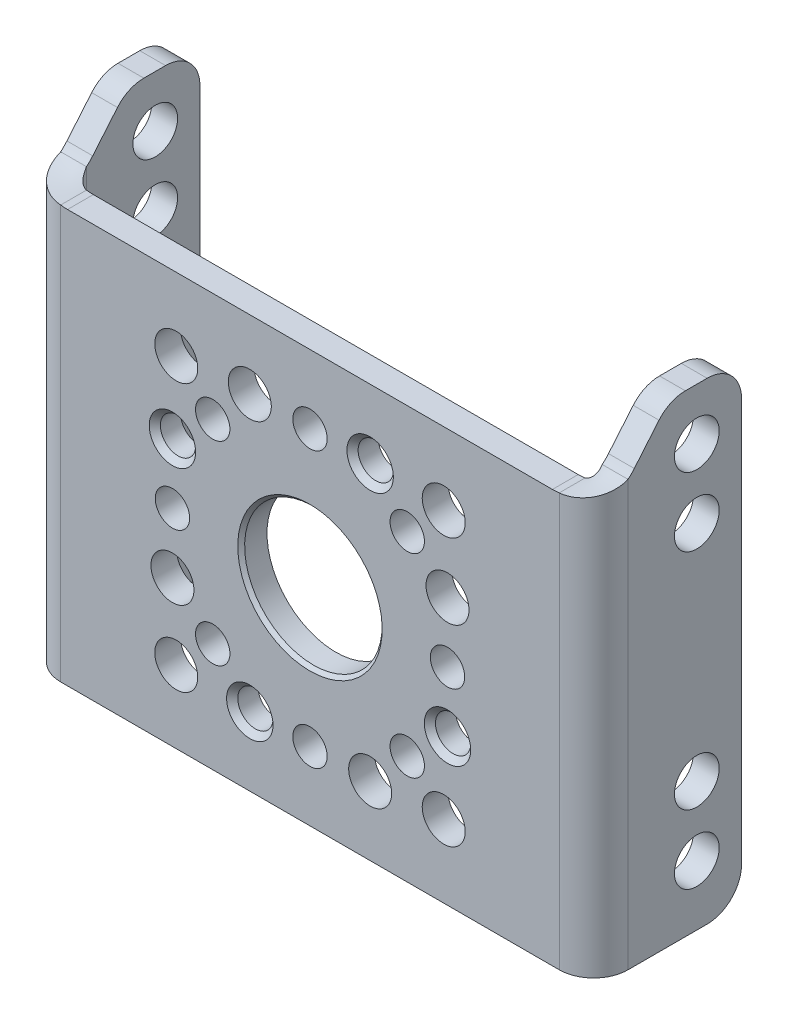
ISO-10303-21;
HEADER;
FILE_DESCRIPTION(('STEP AP214'),'2;1');
FILE_NAME('part.step','',(''),(''),'','','');
FILE_SCHEMA(('AUTOMOTIVE_DESIGN { 1 0 10303 214 1 1 1 1 }'));
ENDSEC;
DATA;
#1=APPLICATION_CONTEXT('core data for automotive mechanical design processes');
#2=APPLICATION_PROTOCOL_DEFINITION('international standard','automotive_design',2000,#1);
#3=PRODUCT_CONTEXT('',#1,'mechanical');
#4=PRODUCT('Part','Part','',(#3));
#5=PRODUCT_RELATED_PRODUCT_CATEGORY('part','',(#4));
#6=PRODUCT_DEFINITION_FORMATION('','',#4);
#7=PRODUCT_DEFINITION_CONTEXT('part definition',#1,'design');
#8=PRODUCT_DEFINITION('design','',#6,#7);
#9=PRODUCT_DEFINITION_SHAPE('','',#8);
#10=(LENGTH_UNIT() NAMED_UNIT(*) SI_UNIT(.MILLI.,.METRE.));
#11=(NAMED_UNIT(*) PLANE_ANGLE_UNIT() SI_UNIT($,.RADIAN.));
#12=(NAMED_UNIT(*) SI_UNIT($,.STERADIAN.) SOLID_ANGLE_UNIT());
#13=UNCERTAINTY_MEASURE_WITH_UNIT(LENGTH_MEASURE(1.E-05),#10,'distance_accuracy_value','');
#14=(GEOMETRIC_REPRESENTATION_CONTEXT(3) GLOBAL_UNCERTAINTY_ASSIGNED_CONTEXT((#13)) GLOBAL_UNIT_ASSIGNED_CONTEXT((#10,
#11,#12)) REPRESENTATION_CONTEXT('',''));
#15=CARTESIAN_POINT('',(0.,0.,0.));
#16=DIRECTION('',(0.,0.,1.));
#17=DIRECTION('',(1.,0.,0.));
#18=AXIS2_PLACEMENT_3D('',#15,#16,#17);
#19=CARTESIAN_POINT('',(51.8499999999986,-222.999999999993,20.9343211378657));
#20=DIRECTION('',(1.,3.31512330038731E-13,3.32373889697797E-13));
#21=DIRECTION('',(3.32373889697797E-13,0.,-1.));
#22=AXIS2_PLACEMENT_3D('',#19,#20,#21);
#23=CYLINDRICAL_SURFACE('',#22,3.00000000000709);
#24=CARTESIAN_POINT('',(53.4999999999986,-222.999999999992,20.9343211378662));
#25=DIRECTION('',(1.,3.31512330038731E-13,3.32373889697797E-13));
#26=DIRECTION('',(3.32373889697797E-13,0.,-1.));
#27=AXIS2_PLACEMENT_3D('',#24,#25,#26);
#28=CIRCLE('',#27,3.00000000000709);
#29=CARTESIAN_POINT('',(53.5,-224.928362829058,18.6361878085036));
#30=VERTEX_POINT('',#29);
#31=CARTESIAN_POINT('',(53.4999999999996,-225.29312052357,19.0000000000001));
#32=VERTEX_POINT('',#31);
#33=EDGE_CURVE('E190',#30,#32,#28,.F.);
#34=ORIENTED_EDGE('',*,*,#33,.F.);
#35=DIRECTION('',(1.,0.,0.));
#36=VECTOR('',#35,1.);
#37=CARTESIAN_POINT('',(53.5,-224.928362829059,18.6361878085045));
#38=LINE('',#37,#36);
#39=CARTESIAN_POINT('',(52.0000000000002,-224.928362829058,18.6361878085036));
#40=VERTEX_POINT('',#39);
#41=EDGE_CURVE('E185',#40,#30,#38,.T.);
#42=ORIENTED_EDGE('',*,*,#41,.F.);
#43=CARTESIAN_POINT('',(51.9999999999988,-222.999999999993,20.9343211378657));
#44=DIRECTION('',(1.,3.31512330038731E-13,3.32373889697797E-13));
#45=DIRECTION('',(3.32373889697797E-13,0.,-1.));
#46=AXIS2_PLACEMENT_3D('',#43,#44,#45);
#47=CIRCLE('',#46,3.00000000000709);
#48=CARTESIAN_POINT('',(52.0000000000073,-225.293120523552,18.9999999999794));
#49=VERTEX_POINT('',#48);
#50=EDGE_CURVE('E24',#49,#40,#47,.T.);
#51=ORIENTED_EDGE('',*,*,#50,.F.);
#52=DIRECTION('',(-1.,0.,-5.37192208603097E-13));
#53=VECTOR('',#52,1.);
#54=CARTESIAN_POINT('',(52.7501755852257,-225.29312052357,19.));
#55=LINE('',#54,#53);
#56=EDGE_CURVE('E182',#32,#49,#55,.T.);
#57=ORIENTED_EDGE('',*,*,#56,.F.);
#58=EDGE_LOOP('',(#34,#42,#51,#57));
#59=FACE_BOUND('',#58,.T.);
#60=ADVANCED_FACE('F17',(#59),#23,.F.);
#61=CARTESIAN_POINT('',(22.15,-222.999999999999,20.9343211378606));
#62=DIRECTION('',(-1.,0.,0.));
#63=DIRECTION('',(0.,0.,1.));
#64=AXIS2_PLACEMENT_3D('',#61,#62,#63);
#65=CYLINDRICAL_SURFACE('',#64,2.99999999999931);
#66=CARTESIAN_POINT('',(20.5,-222.999999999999,20.9343211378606));
#67=DIRECTION('',(-1.,0.,0.));
#68=DIRECTION('',(0.,0.,1.));
#69=AXIS2_PLACEMENT_3D('',#66,#67,#68);
#70=CIRCLE('',#69,2.99999999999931);
#71=CARTESIAN_POINT('',(20.5,-225.29312052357,19.0000000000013));
#72=VERTEX_POINT('',#71);
#73=CARTESIAN_POINT('',(20.5,-224.928362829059,18.6361878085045));
#74=VERTEX_POINT('',#73);
#75=EDGE_CURVE('E237',#72,#74,#70,.F.);
#76=ORIENTED_EDGE('',*,*,#75,.F.);
#77=DIRECTION('',(-1.,0.,1.55402031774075E-12));
#78=VECTOR('',#77,1.);
#79=CARTESIAN_POINT('',(21.2498244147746,-225.29312052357,19.0000000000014));
#80=LINE('',#79,#78);
#81=CARTESIAN_POINT('',(22.0000000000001,-225.29312052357,19.0000000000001));
#82=VERTEX_POINT('',#81);
#83=EDGE_CURVE('E235',#82,#72,#80,.T.);
#84=ORIENTED_EDGE('',*,*,#83,.F.);
#85=CARTESIAN_POINT('',(22.,-222.999999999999,20.9343211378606));
#86=DIRECTION('',(-1.,0.,0.));
#87=DIRECTION('',(0.,0.,1.));
#88=AXIS2_PLACEMENT_3D('',#85,#86,#87);
#89=CIRCLE('',#88,2.99999999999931);
#90=CARTESIAN_POINT('',(22.,-224.928362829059,18.6361878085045));
#91=VERTEX_POINT('',#90);
#92=EDGE_CURVE('E715',#91,#82,#89,.T.);
#93=ORIENTED_EDGE('',*,*,#92,.F.);
#94=DIRECTION('',(1.,0.,0.));
#95=VECTOR('',#94,1.);
#96=CARTESIAN_POINT('',(20.5,-224.928362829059,18.6361878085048));
#97=LINE('',#96,#95);
#98=EDGE_CURVE('E602',#74,#91,#97,.T.);
#99=ORIENTED_EDGE('',*,*,#98,.F.);
#100=EDGE_LOOP('',(#76,#84,#93,#99));
#101=FACE_BOUND('',#100,.T.);
#102=ADVANCED_FACE('F487',(#101),#65,.F.);
#103=CARTESIAN_POINT('',(22.06392933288,-225.26053362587,18.983054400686));
#104=CARTESIAN_POINT('',(22.06370648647,-225.27150155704,18.988656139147));
#105=CARTESIAN_POINT('',(22.06263113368,-225.37472455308,19.042352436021));
#106=CARTESIAN_POINT('',(22.07995525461,-225.55207908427,19.151333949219));
#107=CARTESIAN_POINT('',(22.16643585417,-225.75207814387,19.299298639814));
#108=CARTESIAN_POINT('',(22.31310912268,-225.89680234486,19.408742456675));
#109=CARTESIAN_POINT('',(22.44550175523,-225.95833962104,19.438248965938));
#110=CARTESIAN_POINT('',(22.51673150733,-225.9782054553,19.436161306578));
#111=CARTESIAN_POINT('',(22.52510201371,-225.98036254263,19.435664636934));
#112=CARTESIAN_POINT('',(21.52183443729,-225.26053362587,18.961988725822));
#113=CARTESIAN_POINT('',(21.52133456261,-225.27150155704,18.974554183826));
#114=CARTESIAN_POINT('',(21.51892240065,-225.37472455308,19.09500224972));
#115=CARTESIAN_POINT('',(21.55778275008,-225.55207908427,19.339462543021));
#116=CARTESIAN_POINT('',(21.75177044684,-225.75207814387,19.671367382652));
#117=CARTESIAN_POINT('',(22.08077845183,-225.89680234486,19.916864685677));
#118=CARTESIAN_POINT('',(22.37775305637,-225.95833962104,19.983051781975));
#119=CARTESIAN_POINT('',(22.53753103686,-225.9782054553,19.978368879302));
#120=CARTESIAN_POINT('',(22.55630721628,-225.98036254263,19.977254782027));
#121=CARTESIAN_POINT('',(20.97973954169,-225.26053362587,18.940923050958));
#122=CARTESIAN_POINT('',(20.97896263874,-225.27150155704,18.960452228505));
#123=CARTESIAN_POINT('',(20.97521366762,-225.37472455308,19.147652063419));
#124=CARTESIAN_POINT('',(21.03561024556,-225.55207908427,19.527591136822));
#125=CARTESIAN_POINT('',(21.3371050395,-225.75207814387,20.0434361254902));
#126=CARTESIAN_POINT('',(21.84844778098,-225.89680234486,20.42498691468));
#127=CARTESIAN_POINT('',(22.31000435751,-225.95833962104,20.5278545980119));
#128=CARTESIAN_POINT('',(22.55833056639,-225.9782054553,20.5205764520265));
#129=CARTESIAN_POINT('',(22.58751241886,-225.98036254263,20.5188449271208));
#130=CARTESIAN_POINT('',(20.43764464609,-225.26053362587,18.919857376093));
#131=CARTESIAN_POINT('',(20.43659071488,-225.27150155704,18.946350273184));
#132=CARTESIAN_POINT('',(20.4315049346,-225.37472455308,19.200301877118));
#133=CARTESIAN_POINT('',(20.51343774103,-225.55207908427,19.715719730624));
#134=CARTESIAN_POINT('',(20.92243963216,-225.75207814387,20.4155048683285));
#135=CARTESIAN_POINT('',(21.61611711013,-225.89680234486,20.9331091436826));
#136=CARTESIAN_POINT('',(22.24225565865,-225.95833962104,21.0726574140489));
#137=CARTESIAN_POINT('',(22.57913009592,-225.9782054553,21.0627840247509));
#138=CARTESIAN_POINT('',(22.61871762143,-225.98036254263,21.0604350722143));
#139=B_SPLINE_SURFACE_WITH_KNOTS('',3,3,((#103,#104,#105,#106,#107,#108,#109,#110,#111),(#112,
#113,#114,#115,#116,#117,#118,#119,#120),(#121,#122,#123,#124,#125,#126,#127,#128,#129),(#130,
#131,#132,#133,#134,#135,#136,#137,#138)),.UNSPECIFIED.,.F.,.F.,.F.,(4,4),(4,1,1,1,1,1,4),(0.,
1.),(0.,0.0276684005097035,0.262918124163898,0.498167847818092,0.733417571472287,
0.968667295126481,1.),.UNSPECIFIED.);
#140=DIRECTION('',(0.,0.,1.));
#141=VECTOR('',#140,1.);
#142=CARTESIAN_POINT('',(22.5000000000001,-225.973358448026,19.35));
#143=LINE('',#142,#141);
#144=CARTESIAN_POINT('',(22.5000000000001,-225.973358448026,21.));
#145=VERTEX_POINT('',#144);
#146=CARTESIAN_POINT('',(22.5000000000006,-225.973358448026,19.5));
#147=VERTEX_POINT('',#146);
#148=EDGE_CURVE('E506',#145,#147,#143,.F.);
#149=CARTESIAN_POINT('',(22.5000000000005,-225.973358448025,19.4999999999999));
#150=CARTESIAN_POINT('',(22.4725380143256,-225.966163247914,19.5000295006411));
#151=CARTESIAN_POINT('',(22.4455211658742,-225.957585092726,19.4977420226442));
#152=CARTESIAN_POINT('',(22.3932550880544,-225.93800139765,19.4891759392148));
#153=CARTESIAN_POINT('',(22.3679947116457,-225.9270134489,19.4829256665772));
#154=CARTESIAN_POINT('',(22.319784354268,-225.902875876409,19.4670838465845));
#155=CARTESIAN_POINT('',(22.2968276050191,-225.889732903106,19.4575024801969));
#156=CARTESIAN_POINT('',(22.2534744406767,-225.861513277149,19.4356782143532));
#157=CARTESIAN_POINT('',(22.2330829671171,-225.846433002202,19.4234302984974));
#158=CARTESIAN_POINT('',(22.1875921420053,-225.808360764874,19.3917168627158));
#159=CARTESIAN_POINT('',(22.1637983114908,-225.784590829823,19.3713078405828));
#160=CARTESIAN_POINT('',(22.1216638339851,-225.734390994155,19.3282889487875));
#161=CARTESIAN_POINT('',(22.1033308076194,-225.707957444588,19.3056760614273));
#162=CARTESIAN_POINT('',(22.0658506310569,-225.642773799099,19.2509627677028));
#163=CARTESIAN_POINT('',(22.0489267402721,-225.603093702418,19.218456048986));
#164=CARTESIAN_POINT('',(22.0231045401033,-225.520615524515,19.1542020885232));
#165=CARTESIAN_POINT('',(22.014223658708,-225.477810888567,19.1224566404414));
#166=CARTESIAN_POINT('',(22.0055100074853,-225.410936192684,19.0757894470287));
#167=CARTESIAN_POINT('',(22.0033817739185,-225.387675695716,19.0600698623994));
#168=CARTESIAN_POINT('',(22.0006316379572,-225.340731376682,19.0294327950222));
#169=CARTESIAN_POINT('',(22.0000012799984,-225.317050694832,19.0145112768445));
#170=CARTESIAN_POINT('',(22.,-225.293120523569,19.0000000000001));
#171=B_SPLINE_CURVE_WITH_KNOTS('',3,(#149,#150,#151,#152,#153,#154,#155,#156,#157,#158,#159,
#160,#161,#162,#163,#164,#165,#166,#167,#168,#169,#170),.UNSPECIFIED.,.F.,.F.,(4,2,2,2,2,2,2,2,
2,2,4),(0.,0.084920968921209,0.169241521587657,0.253306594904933,0.337531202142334,
0.454902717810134,0.572437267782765,0.733594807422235,0.895100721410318,0.979519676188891,
1.06346093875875),.UNSPECIFIED.);
#172=EDGE_CURVE('E234',#147,#82,#171,.T.);
#173=CARTESIAN_POINT('',(22.5000000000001,-225.973358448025,21.));
#174=CARTESIAN_POINT('',(22.4521352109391,-225.970219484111,21.0000006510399));
#175=CARTESIAN_POINT('',(22.4043041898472,-225.966801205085,20.998281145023));
#176=CARTESIAN_POINT('',(22.3089388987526,-225.959401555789,20.9914269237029));
#177=CARTESIAN_POINT('',(22.2614045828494,-225.955420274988,20.9862927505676));
#178=CARTESIAN_POINT('',(22.1196271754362,-225.942628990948,20.9658136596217));
#179=CARTESIAN_POINT('',(22.0261487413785,-225.932967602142,20.9453921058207));
#180=CARTESIAN_POINT('',(21.8281892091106,-225.909536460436,20.8870622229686));
#181=CARTESIAN_POINT('',(21.7244421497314,-225.895351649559,20.8468221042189));
#182=CARTESIAN_POINT('',(21.5254098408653,-225.863719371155,20.7499795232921));
#183=CARTESIAN_POINT('',(21.4301269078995,-225.84627101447,20.6933725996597));
#184=CARTESIAN_POINT('',(21.249706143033,-225.807861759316,20.5649746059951));
#185=CARTESIAN_POINT('',(21.1646809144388,-225.786867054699,20.4930354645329));
#186=CARTESIAN_POINT('',(21.0081834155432,-225.741252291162,20.3366825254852));
#187=CARTESIAN_POINT('',(20.9367101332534,-225.716632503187,20.2522696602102));
#188=CARTESIAN_POINT('',(20.8079298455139,-225.66319268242,20.0720871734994));
#189=CARTESIAN_POINT('',(20.7508910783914,-225.634306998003,19.9761454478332));
#190=CARTESIAN_POINT('',(20.653868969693,-225.572379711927,19.7772083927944));
#191=CARTESIAN_POINT('',(20.6138918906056,-225.539336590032,19.674210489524));
#192=CARTESIAN_POINT('',(20.5549684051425,-225.472565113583,19.4757926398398));
#193=CARTESIAN_POINT('',(20.5342206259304,-225.439293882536,19.3807513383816));
#194=CARTESIAN_POINT('',(20.5136066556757,-225.386635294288,19.2378278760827));
#195=CARTESIAN_POINT('',(20.5084865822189,-225.368628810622,19.1901388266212));
#196=CARTESIAN_POINT('',(20.5016821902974,-225.331630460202,19.0948993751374));
#197=CARTESIAN_POINT('',(20.4999977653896,-225.312638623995,19.0473489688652));
#198=CARTESIAN_POINT('',(20.5,-225.293120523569,19.0000000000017));
#199=B_SPLINE_CURVE_WITH_KNOTS('',3,(#173,#174,#175,#176,#177,#178,#179,#180,#181,#182,#183,
#184,#185,#186,#187,#188,#189,#190,#191,#192,#193,#194,#195,#196,#197,#198),.UNSPECIFIED.,.F.,
.F.,(4,2,2,2,2,2,2,2,2,2,2,2,4),(0.,0.143840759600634,0.287658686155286,0.575113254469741,
0.910063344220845,1.24510482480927,1.58354182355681,1.92195353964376,2.26625577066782,
2.61068426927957,2.91801573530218,3.07160219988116,3.22518390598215),.UNSPECIFIED.);
#200=EDGE_CURVE('E498',#145,#72,#199,.T.);
#201=ORIENTED_EDGE('',*,*,#148,.T.);
#202=ORIENTED_EDGE('',*,*,#172,.T.);
#203=ORIENTED_EDGE('',*,*,#83,.T.);
#204=ORIENTED_EDGE('',*,*,#200,.F.);
#205=EDGE_LOOP('',(#201,#202,#203,#204));
#206=FACE_BOUND('',#205,.T.);
#207=ADVANCED_FACE('F480',(#206),#139,.T.);
#208=CARTESIAN_POINT('',(53.65,-229.5,15.));
#209=DIRECTION('',(-1.,0.,0.));
#210=DIRECTION('',(0.,0.,1.));
#211=AXIS2_PLACEMENT_3D('',#208,#209,#210);
#212=CYLINDRICAL_SURFACE('',#211,1.30000000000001);
#213=CARTESIAN_POINT('',(52.,-229.5,15.));
#214=DIRECTION('',(-1.,0.,0.));
#215=DIRECTION('',(0.,0.,1.));
#216=AXIS2_PLACEMENT_3D('',#213,#214,#215);
#217=CIRCLE('',#216,1.30000000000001);
#218=CARTESIAN_POINT('',(52.,-229.5,16.3));
#219=VERTEX_POINT('',#218);
#220=EDGE_CURVE('E1141',#219,#219,#217,.F.);
#221=ORIENTED_EDGE('',*,*,#220,.F.);
#222=EDGE_LOOP('',(#221));
#223=FACE_BOUND('',#222,.T.);
#224=CARTESIAN_POINT('',(53.5,-229.5,15.));
#225=DIRECTION('',(-1.,0.,0.));
#226=DIRECTION('',(0.,0.,1.));
#227=AXIS2_PLACEMENT_3D('',#224,#225,#226);
#228=CIRCLE('',#227,1.30000000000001);
#229=CARTESIAN_POINT('',(53.5,-229.5,16.3));
#230=VERTEX_POINT('',#229);
#231=EDGE_CURVE('E1144',#230,#230,#228,.T.);
#232=ORIENTED_EDGE('',*,*,#231,.F.);
#233=EDGE_LOOP('',(#232));
#234=FACE_BOUND('',#233,.T.);
#235=ADVANCED_FACE('F486',(#223,#234),#212,.F.);
#236=CARTESIAN_POINT('',(53.65,-246.5,15.));
#237=DIRECTION('',(-1.,0.,0.));
#238=DIRECTION('',(0.,0.,1.));
#239=AXIS2_PLACEMENT_3D('',#236,#237,#238);
#240=CYLINDRICAL_SURFACE('',#239,1.30000000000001);
#241=CARTESIAN_POINT('',(52.,-246.5,15.));
#242=DIRECTION('',(-1.,0.,0.));
#243=DIRECTION('',(0.,0.,1.));
#244=AXIS2_PLACEMENT_3D('',#241,#242,#243);
#245=CIRCLE('',#244,1.30000000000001);
#246=CARTESIAN_POINT('',(52.,-246.5,16.3));
#247=VERTEX_POINT('',#246);
#248=EDGE_CURVE('E1151',#247,#247,#245,.F.);
#249=ORIENTED_EDGE('',*,*,#248,.F.);
#250=EDGE_LOOP('',(#249));
#251=FACE_BOUND('',#250,.T.);
#252=CARTESIAN_POINT('',(53.5,-246.5,15.));
#253=DIRECTION('',(-1.,0.,0.));
#254=DIRECTION('',(0.,0.,1.));
#255=AXIS2_PLACEMENT_3D('',#252,#253,#254);
#256=CIRCLE('',#255,1.30000000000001);
#257=CARTESIAN_POINT('',(53.5,-246.5,16.3));
#258=VERTEX_POINT('',#257);
#259=EDGE_CURVE('E1146',#258,#258,#256,.T.);
#260=ORIENTED_EDGE('',*,*,#259,.F.);
#261=EDGE_LOOP('',(#260));
#262=FACE_BOUND('',#261,.T.);
#263=ADVANCED_FACE('F886',(#251,#262),#240,.F.);
#264=CARTESIAN_POINT('',(53.65,-225.5,15.));
#265=DIRECTION('',(-1.,0.,0.));
#266=DIRECTION('',(0.,0.,1.));
#267=AXIS2_PLACEMENT_3D('',#264,#265,#266);
#268=CYLINDRICAL_SURFACE('',#267,1.30000000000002);
#269=CARTESIAN_POINT('',(53.5,-225.5,15.));
#270=DIRECTION('',(-1.,0.,0.));
#271=DIRECTION('',(0.,0.,1.));
#272=AXIS2_PLACEMENT_3D('',#269,#270,#271);
#273=CIRCLE('',#272,1.30000000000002);
#274=CARTESIAN_POINT('',(53.5,-225.5,16.3));
#275=VERTEX_POINT('',#274);
#276=EDGE_CURVE('E1149',#275,#275,#273,.T.);
#277=ORIENTED_EDGE('',*,*,#276,.F.);
#278=EDGE_LOOP('',(#277));
#279=FACE_BOUND('',#278,.T.);
#280=CARTESIAN_POINT('',(52.,-225.5,15.));
#281=DIRECTION('',(-1.,0.,0.));
#282=DIRECTION('',(0.,0.,1.));
#283=AXIS2_PLACEMENT_3D('',#280,#281,#282);
#284=CIRCLE('',#283,1.30000000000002);
#285=CARTESIAN_POINT('',(52.,-225.5,16.3));
#286=VERTEX_POINT('',#285);
#287=EDGE_CURVE('E1157',#286,#286,#284,.F.);
#288=ORIENTED_EDGE('',*,*,#287,.F.);
#289=EDGE_LOOP('',(#288));
#290=FACE_BOUND('',#289,.T.);
#291=ADVANCED_FACE('F878',(#279,#290),#268,.F.);
#292=CARTESIAN_POINT('',(53.65,-242.5,15.));
#293=DIRECTION('',(-1.,0.,0.));
#294=DIRECTION('',(0.,0.,1.));
#295=AXIS2_PLACEMENT_3D('',#292,#293,#294);
#296=CYLINDRICAL_SURFACE('',#295,1.30000000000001);
#297=CARTESIAN_POINT('',(53.5,-242.5,15.));
#298=DIRECTION('',(-1.,0.,0.));
#299=DIRECTION('',(0.,0.,1.));
#300=AXIS2_PLACEMENT_3D('',#297,#298,#299);
#301=CIRCLE('',#300,1.30000000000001);
#302=CARTESIAN_POINT('',(53.5,-242.5,16.3));
#303=VERTEX_POINT('',#302);
#304=EDGE_CURVE('E1225',#303,#303,#301,.T.);
#305=ORIENTED_EDGE('',*,*,#304,.F.);
#306=EDGE_LOOP('',(#305));
#307=FACE_BOUND('',#306,.T.);
#308=CARTESIAN_POINT('',(52.,-242.5,15.));
#309=DIRECTION('',(-1.,0.,0.));
#310=DIRECTION('',(0.,0.,1.));
#311=AXIS2_PLACEMENT_3D('',#308,#309,#310);
#312=CIRCLE('',#311,1.30000000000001);
#313=CARTESIAN_POINT('',(52.,-242.5,16.3));
#314=VERTEX_POINT('',#313);
#315=EDGE_CURVE('E1160',#314,#314,#312,.F.);
#316=ORIENTED_EDGE('',*,*,#315,.F.);
#317=EDGE_LOOP('',(#316));
#318=FACE_BOUND('',#317,.T.);
#319=ADVANCED_FACE('F870',(#307,#318),#296,.F.);
#320=CARTESIAN_POINT('',(51.85,-248.,14.4));
#321=DIRECTION('',(1.,0.,0.));
#322=DIRECTION('',(0.,0.,-1.));
#323=AXIS2_PLACEMENT_3D('',#320,#321,#322);
#324=CYLINDRICAL_SURFACE('',#323,2.00000000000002);
#325=DIRECTION('',(1.,0.,0.));
#326=VECTOR('',#325,1.);
#327=CARTESIAN_POINT('',(51.85,-250.,14.4));
#328=LINE('',#327,#326);
#329=CARTESIAN_POINT('',(53.5,-250.,14.4));
#330=VERTEX_POINT('',#329);
#331=CARTESIAN_POINT('',(52.0000000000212,-250.,14.4));
#332=VERTEX_POINT('',#331);
#333=EDGE_CURVE('E232',#330,#332,#328,.F.);
#334=ORIENTED_EDGE('',*,*,#333,.T.);
#335=CARTESIAN_POINT('',(52.,-248.,14.4));
#336=DIRECTION('',(1.,0.,0.));
#337=DIRECTION('',(0.,0.,-1.));
#338=AXIS2_PLACEMENT_3D('',#335,#336,#337);
#339=CIRCLE('',#338,2.00000000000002);
#340=CARTESIAN_POINT('',(52.,-248.,12.4));
#341=VERTEX_POINT('',#340);
#342=EDGE_CURVE('E1171',#341,#332,#339,.F.);
#343=ORIENTED_EDGE('',*,*,#342,.F.);
#344=DIRECTION('',(-1.,0.,0.));
#345=VECTOR('',#344,1.);
#346=CARTESIAN_POINT('',(53.5,-248.,12.4));
#347=LINE('',#346,#345);
#348=CARTESIAN_POINT('',(53.5,-248.,12.4));
#349=VERTEX_POINT('',#348);
#350=EDGE_CURVE('E230',#349,#341,#347,.T.);
#351=ORIENTED_EDGE('',*,*,#350,.F.);
#352=CARTESIAN_POINT('',(53.5,-248.,14.4));
#353=DIRECTION('',(1.,0.,0.));
#354=DIRECTION('',(0.,0.,-1.));
#355=AXIS2_PLACEMENT_3D('',#352,#353,#354);
#356=CIRCLE('',#355,2.00000000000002);
#357=EDGE_CURVE('E1221',#330,#349,#356,.T.);
#358=ORIENTED_EDGE('',*,*,#357,.F.);
#359=EDGE_LOOP('',(#334,#343,#351,#358));
#360=FACE_BOUND('',#359,.T.);
#361=ADVANCED_FACE('F862',(#360),#324,.T.);
#362=CARTESIAN_POINT('',(53.5,-224.5,12.4));
#363=DIRECTION('',(0.,0.,-1.));
#364=DIRECTION('',(-1.,0.,0.));
#365=AXIS2_PLACEMENT_3D('',#362,#363,#364);
#366=PLANE('',#365);
#367=DIRECTION('',(0.,1.,0.));
#368=VECTOR('',#367,1.);
#369=CARTESIAN_POINT('',(52.,-250.,12.4));
#370=LINE('',#369,#368);
#371=CARTESIAN_POINT('',(52.,-224.5,12.4));
#372=VERTEX_POINT('',#371);
#373=EDGE_CURVE('E1173',#372,#341,#370,.F.);
#374=ORIENTED_EDGE('',*,*,#373,.F.);
#375=DIRECTION('',(1.,0.,0.));
#376=VECTOR('',#375,1.);
#377=CARTESIAN_POINT('',(51.85,-224.5,12.4));
#378=LINE('',#377,#376);
#379=CARTESIAN_POINT('',(53.5,-224.5,12.4));
#380=VERTEX_POINT('',#379);
#381=EDGE_CURVE('E227',#380,#372,#378,.F.);
#382=ORIENTED_EDGE('',*,*,#381,.F.);
#383=DIRECTION('',(0.,1.,0.));
#384=VECTOR('',#383,1.);
#385=CARTESIAN_POINT('',(53.5,-250.,12.4));
#386=LINE('',#385,#384);
#387=EDGE_CURVE('E690',#349,#380,#386,.T.);
#388=ORIENTED_EDGE('',*,*,#387,.F.);
#389=ORIENTED_EDGE('',*,*,#350,.T.);
#390=EDGE_LOOP('',(#374,#382,#388,#389));
#391=FACE_BOUND('',#390,.T.);
#392=ADVANCED_FACE('F854',(#391),#366,.T.);
#393=CARTESIAN_POINT('',(51.85,-224.5,14.4));
#394=DIRECTION('',(1.,0.,0.));
#395=DIRECTION('',(0.,0.,-1.));
#396=AXIS2_PLACEMENT_3D('',#393,#394,#395);
#397=CYLINDRICAL_SURFACE('',#396,1.99999999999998);
#398=ORIENTED_EDGE('',*,*,#381,.T.);
#399=CARTESIAN_POINT('',(52.,-224.5,14.4));
#400=DIRECTION('',(1.,0.,0.));
#401=DIRECTION('',(0.,0.,-1.));
#402=AXIS2_PLACEMENT_3D('',#399,#400,#401);
#403=CIRCLE('',#402,1.99999999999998);
#404=CARTESIAN_POINT('',(52.,-222.5,14.4));
#405=VERTEX_POINT('',#404);
#406=EDGE_CURVE('E1163',#405,#372,#403,.F.);
#407=ORIENTED_EDGE('',*,*,#406,.F.);
#408=DIRECTION('',(1.,0.,0.));
#409=VECTOR('',#408,1.);
#410=CARTESIAN_POINT('',(53.5,-222.5,14.4));
#411=LINE('',#410,#409);
#412=CARTESIAN_POINT('',(53.5,-222.5,14.4));
#413=VERTEX_POINT('',#412);
#414=EDGE_CURVE('E225',#413,#405,#411,.F.);
#415=ORIENTED_EDGE('',*,*,#414,.F.);
#416=CARTESIAN_POINT('',(53.5,-224.5,14.3999999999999));
#417=DIRECTION('',(1.,0.,0.));
#418=DIRECTION('',(0.,0.,-1.));
#419=AXIS2_PLACEMENT_3D('',#416,#417,#418);
#420=CIRCLE('',#419,1.99999999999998);
#421=EDGE_CURVE('E1215',#380,#413,#420,.T.);
#422=ORIENTED_EDGE('',*,*,#421,.F.);
#423=EDGE_LOOP('',(#398,#407,#415,#422));
#424=FACE_BOUND('',#423,.T.);
#425=ADVANCED_FACE('F846',(#424),#397,.T.);
#426=CARTESIAN_POINT('',(53.5,-222.5,15.665934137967));
#427=DIRECTION('',(0.,1.,0.));
#428=DIRECTION('',(0.,0.,1.));
#429=AXIS2_PLACEMENT_3D('',#426,#427,#428);
#430=PLANE('',#429);
#431=DIRECTION('',(0.,0.,1.));
#432=VECTOR('',#431,1.);
#433=CARTESIAN_POINT('',(52.,-222.5,19.));
#434=LINE('',#433,#432);
#435=CARTESIAN_POINT('',(52.,-222.5,15.665934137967));
#436=VERTEX_POINT('',#435);
#437=EDGE_CURVE('E1166',#436,#405,#434,.F.);
#438=ORIENTED_EDGE('',*,*,#437,.F.);
#439=DIRECTION('',(1.,0.,0.));
#440=VECTOR('',#439,1.);
#441=CARTESIAN_POINT('',(51.85,-222.5,15.665934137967));
#442=LINE('',#441,#440);
#443=CARTESIAN_POINT('',(53.5,-222.5,15.665934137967));
#444=VERTEX_POINT('',#443);
#445=EDGE_CURVE('E222',#444,#436,#442,.F.);
#446=ORIENTED_EDGE('',*,*,#445,.F.);
#447=DIRECTION('',(0.,0.,-1.));
#448=VECTOR('',#447,1.);
#449=CARTESIAN_POINT('',(53.5,-222.5,19.));
#450=LINE('',#449,#448);
#451=EDGE_CURVE('E1213',#413,#444,#450,.F.);
#452=ORIENTED_EDGE('',*,*,#451,.F.);
#453=ORIENTED_EDGE('',*,*,#414,.T.);
#454=EDGE_LOOP('',(#438,#446,#452,#453));
#455=FACE_BOUND('',#454,.T.);
#456=ADVANCED_FACE('F838',(#455),#430,.T.);
#457=CARTESIAN_POINT('',(51.85,-224.5,15.665934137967));
#458=DIRECTION('',(1.,0.,0.));
#459=DIRECTION('',(0.,1.,0.));
#460=AXIS2_PLACEMENT_3D('',#457,#458,#459);
#461=CYLINDRICAL_SURFACE('',#460,1.99999999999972);
#462=ORIENTED_EDGE('',*,*,#445,.T.);
#463=CARTESIAN_POINT('',(52.0000000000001,-224.5,15.665934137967));
#464=DIRECTION('',(1.,0.,0.));
#465=DIRECTION('',(0.,1.,0.));
#466=AXIS2_PLACEMENT_3D('',#463,#464,#465);
#467=CIRCLE('',#466,1.99999999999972);
#468=CARTESIAN_POINT('',(52.,-223.214424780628,17.1980230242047));
#469=VERTEX_POINT('',#468);
#470=EDGE_CURVE('E1167',#469,#436,#467,.F.);
#471=ORIENTED_EDGE('',*,*,#470,.F.);
#472=DIRECTION('',(1.,0.,0.));
#473=VECTOR('',#472,1.);
#474=CARTESIAN_POINT('',(53.5,-223.214424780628,17.1980230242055));
#475=LINE('',#474,#473);
#476=CARTESIAN_POINT('',(53.5,-223.214424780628,17.1980230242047));
#477=VERTEX_POINT('',#476);
#478=EDGE_CURVE('E217',#477,#469,#475,.F.);
#479=ORIENTED_EDGE('',*,*,#478,.F.);
#480=CARTESIAN_POINT('',(53.5,-224.5,15.665934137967));
#481=DIRECTION('',(1.,0.,0.));
#482=DIRECTION('',(0.,1.,0.));
#483=AXIS2_PLACEMENT_3D('',#480,#481,#482);
#484=CIRCLE('',#483,1.99999999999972);
#485=EDGE_CURVE('E417',#444,#477,#484,.T.);
#486=ORIENTED_EDGE('',*,*,#485,.F.);
#487=EDGE_LOOP('',(#462,#471,#479,#486));
#488=FACE_BOUND('',#487,.T.);
#489=ADVANCED_FACE('F830',(#488),#461,.T.);
#490=CARTESIAN_POINT('',(53.5,-224.92836282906,18.6361878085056));
#491=DIRECTION('',(0.,0.642787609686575,0.766044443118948));
#492=DIRECTION('',(0.,-0.766044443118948,0.642787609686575));
#493=AXIS2_PLACEMENT_3D('',#490,#491,#492);
#494=PLANE('',#493);
#495=DIRECTION('',(0.,0.766044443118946,-0.642787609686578));
#496=VECTOR('',#495,1.);
#497=CARTESIAN_POINT('',(52.,-224.928362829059,18.6361878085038));
#498=LINE('',#497,#496);
#499=EDGE_CURVE('E1170',#40,#469,#498,.T.);
#500=ORIENTED_EDGE('',*,*,#499,.F.);
#501=ORIENTED_EDGE('',*,*,#41,.T.);
#502=DIRECTION('',(0.,-0.766044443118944,0.642787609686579));
#503=VECTOR('',#502,1.);
#504=CARTESIAN_POINT('',(53.5,-223.214424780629,17.1980230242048));
#505=LINE('',#504,#503);
#506=EDGE_CURVE('E416',#477,#30,#505,.T.);
#507=ORIENTED_EDGE('',*,*,#506,.F.);
#508=ORIENTED_EDGE('',*,*,#478,.T.);
#509=EDGE_LOOP('',(#500,#501,#507,#508));
#510=FACE_BOUND('',#509,.T.);
#511=ADVANCED_FACE('F824',(#510),#494,.T.);
#512=CARTESIAN_POINT('',(51.47495708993,-225.98034730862,19.43566813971));
#513=CARTESIAN_POINT('',(51.48330790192,-225.97819446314,19.436162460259));
#514=CARTESIAN_POINT('',(51.55451770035,-225.95833057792,19.438244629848));
#515=CARTESIAN_POINT('',(51.68689087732,-225.89680234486,19.408742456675));
#516=CARTESIAN_POINT('',(51.83356414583,-225.75207814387,19.299298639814));
#517=CARTESIAN_POINT('',(51.92004474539,-225.55207908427,19.151333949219));
#518=CARTESIAN_POINT('',(51.93737906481,-225.37462014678,19.04228828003));
#519=CARTESIAN_POINT('',(51.93629110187,-225.27127127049,18.988536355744));
#520=CARTESIAN_POINT('',(51.93606354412,-225.26018483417,18.982876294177));
#521=CARTESIAN_POINT('',(51.44382536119,-225.98034730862,19.97726263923));
#522=CARTESIAN_POINT('',(51.46255736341,-225.97819446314,19.978371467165));
#523=CARTESIAN_POINT('',(51.62229058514,-225.95833057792,19.983042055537));
#524=CARTESIAN_POINT('',(51.91922154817,-225.89680234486,19.916864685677));
#525=CARTESIAN_POINT('',(52.24822955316,-225.75207814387,19.671367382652));
#526=CARTESIAN_POINT('',(52.44221724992,-225.55207908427,19.339462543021));
#527=CARTESIAN_POINT('',(52.48110047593,-225.37462014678,19.094858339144));
#528=CARTESIAN_POINT('',(52.47866002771,-225.27127127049,18.974285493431));
#529=CARTESIAN_POINT('',(52.47814958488,-225.26018483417,18.961589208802));
#530=CARTESIAN_POINT('',(51.41269363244,-225.98034730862,20.5188571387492));
#531=CARTESIAN_POINT('',(51.44180682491,-225.97819446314,20.5205804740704));
#532=CARTESIAN_POINT('',(51.69006346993,-225.95833057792,20.527839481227));
#533=CARTESIAN_POINT('',(52.15155221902,-225.89680234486,20.42498691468));
#534=CARTESIAN_POINT('',(52.6628949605,-225.75207814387,20.0434361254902));
#535=CARTESIAN_POINT('',(52.96438975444,-225.55207908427,19.527591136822));
#536=CARTESIAN_POINT('',(53.02482188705,-225.37462014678,19.147428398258));
#537=CARTESIAN_POINT('',(53.02102895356,-225.27127127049,18.960034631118));
#538=CARTESIAN_POINT('',(53.02023562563,-225.26018483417,18.940302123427));
#539=CARTESIAN_POINT('',(51.3815619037,-225.98034730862,21.0604516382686));
#540=CARTESIAN_POINT('',(51.42105628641,-225.97819446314,21.0627894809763));
#541=CARTESIAN_POINT('',(51.75783635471,-225.95833057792,21.0726369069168));
#542=CARTESIAN_POINT('',(52.38388288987,-225.89680234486,20.9331091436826));
#543=CARTESIAN_POINT('',(53.07756036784,-225.75207814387,20.4155048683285));
#544=CARTESIAN_POINT('',(53.48656225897,-225.55207908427,19.715719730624));
#545=CARTESIAN_POINT('',(53.56854329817,-225.37462014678,19.199998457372));
#546=CARTESIAN_POINT('',(53.56339787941,-225.27127127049,18.945783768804));
#547=CARTESIAN_POINT('',(53.56232166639,-225.26018483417,18.919015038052));
#548=B_SPLINE_SURFACE_WITH_KNOTS('',3,3,((#512,#513,#514,#515,#516,#517,#518,#519,#520),(#521,
#522,#523,#524,#525,#526,#527,#528,#529),(#530,#531,#532,#533,#534,#535,#536,#537,#538),(#539,
#540,#541,#542,#543,#544,#545,#546,#547)),.UNSPECIFIED.,.F.,.F.,.F.,(4,4),(4,1,1,1,1,1,4),(0.,
1.),(0.,0.0312520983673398,0.266450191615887,0.501648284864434,0.736846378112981,
0.972044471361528,1.),.UNSPECIFIED.);
#549=CARTESIAN_POINT('',(52.0000000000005,-225.29312052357,18.9999999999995));
#550=CARTESIAN_POINT('',(51.9999952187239,-225.323919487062,19.0186712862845));
#551=CARTESIAN_POINT('',(51.9989523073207,-225.354327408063,19.0380455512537));
#552=CARTESIAN_POINT('',(51.9942929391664,-225.414326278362,19.0779885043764));
#553=CARTESIAN_POINT('',(51.9906655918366,-225.443913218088,19.0985619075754));
#554=CARTESIAN_POINT('',(51.9802656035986,-225.502343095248,19.1407969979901));
#555=CARTESIAN_POINT('',(51.9734532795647,-225.531171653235,19.1624692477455));
#556=CARTESIAN_POINT('',(51.9561270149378,-225.587349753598,19.2061504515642));
#557=CARTESIAN_POINT('',(51.9456205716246,-225.614702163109,19.2281586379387));
#558=CARTESIAN_POINT('',(51.9195659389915,-225.669566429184,19.2732946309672));
#559=CARTESIAN_POINT('',(51.9037234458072,-225.696962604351,19.2963967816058));
#560=CARTESIAN_POINT('',(51.8668290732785,-225.749265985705,19.3409797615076));
#561=CARTESIAN_POINT('',(51.8458021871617,-225.774184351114,19.362467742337));
#562=CARTESIAN_POINT('',(51.8021324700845,-225.817381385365,19.3992442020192));
#563=CARTESIAN_POINT('',(51.7802856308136,-225.836084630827,19.4149745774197));
#564=CARTESIAN_POINT('',(51.7328867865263,-225.871114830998,19.4433109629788));
#565=CARTESIAN_POINT('',(51.7073334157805,-225.887440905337,19.4559158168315));
#566=CARTESIAN_POINT('',(51.6573674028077,-225.914841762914,19.4752203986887));
#567=CARTESIAN_POINT('',(51.6334268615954,-225.926338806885,19.4825423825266));
#568=CARTESIAN_POINT('',(51.5838364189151,-225.947059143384,19.4935706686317));
#569=CARTESIAN_POINT('',(51.5581916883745,-225.956288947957,19.4972874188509));
#570=CARTESIAN_POINT('',(51.5214451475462,-225.967506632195,19.4996550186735));
#571=CARTESIAN_POINT('',(51.5107493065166,-225.970540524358,19.5000034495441));
#572=CARTESIAN_POINT('',(51.5000000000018,-225.973358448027,19.5000000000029));
#573=B_SPLINE_CURVE_WITH_KNOTS('',3,(#549,#550,#551,#552,#553,#554,#555,#556,#557,#558,#559,
#560,#561,#562,#563,#564,#565,#566,#567,#568,#569,#570,#571,#572),.UNSPECIFIED.,.F.,.F.,(4,2,2,
2,2,2,2,2,2,2,2,4),(0.,0.108071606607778,0.216601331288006,0.326520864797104,0.436218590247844,
0.553377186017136,0.669981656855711,0.767941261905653,0.86593705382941,0.948247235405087,
1.03031816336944,1.0636591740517),.UNSPECIFIED.);
#574=CARTESIAN_POINT('',(51.5000000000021,-225.973358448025,19.5000000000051));
#575=VERTEX_POINT('',#574);
#576=EDGE_CURVE('E194',#49,#575,#573,.T.);
#577=DIRECTION('',(0.,0.,1.));
#578=VECTOR('',#577,1.);
#579=CARTESIAN_POINT('',(51.5000000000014,-225.973358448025,19.35));
#580=LINE('',#579,#578);
#581=CARTESIAN_POINT('',(51.4999999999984,-225.973358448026,21.));
#582=VERTEX_POINT('',#581);
#583=EDGE_CURVE('E596',#575,#582,#580,.T.);
#584=CARTESIAN_POINT('',(53.5,-225.29312052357,18.9999999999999));
#585=CARTESIAN_POINT('',(53.5000100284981,-225.316482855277,19.0566848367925));
#586=CARTESIAN_POINT('',(53.4975900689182,-225.33910475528,19.1136769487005));
#587=CARTESIAN_POINT('',(53.4878087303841,-225.382953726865,19.2277852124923));
#588=CARTESIAN_POINT('',(53.4804464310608,-225.404180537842,19.2849013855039));
#589=CARTESIAN_POINT('',(53.4606933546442,-225.445328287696,19.3987777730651));
#590=CARTESIAN_POINT('',(53.4482997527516,-225.465248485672,19.4555377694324));
#591=CARTESIAN_POINT('',(53.4184913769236,-225.503803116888,19.5681449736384));
#592=CARTESIAN_POINT('',(53.4010770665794,-225.522437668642,19.6239922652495));
#593=CARTESIAN_POINT('',(53.3414512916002,-225.576336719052,19.7891012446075));
#594=CARTESIAN_POINT('',(53.2917790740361,-225.609757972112,19.8963854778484));
#595=CARTESIAN_POINT('',(53.173640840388,-225.672049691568,20.1013294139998));
#596=CARTESIAN_POINT('',(53.1051908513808,-225.700924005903,20.1989972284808));
#597=CARTESIAN_POINT('',(52.9542596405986,-225.753302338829,20.3777806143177));
#598=CARTESIAN_POINT('',(52.8724181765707,-225.77697000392,20.4593877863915));
#599=CARTESIAN_POINT('',(52.6952609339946,-225.82053884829,20.6076994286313));
#600=CARTESIAN_POINT('',(52.599941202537,-225.840438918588,20.6743995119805));
#601=CARTESIAN_POINT('',(52.4012670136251,-225.876151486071,20.7890054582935));
#602=CARTESIAN_POINT('',(52.2981810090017,-225.892055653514,20.8373490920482));
#603=CARTESIAN_POINT('',(52.0849444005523,-225.920490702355,20.9159113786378));
#604=CARTESIAN_POINT('',(51.9748016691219,-225.933025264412,20.9461498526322));
#605=CARTESIAN_POINT('',(51.8030524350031,-225.949760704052,20.9778446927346));
#606=CARTESIAN_POINT('',(51.742744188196,-225.955123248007,20.9861470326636));
#607=CARTESIAN_POINT('',(51.6216436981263,-225.96492573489,20.9972210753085));
#608=CARTESIAN_POINT('',(51.5608523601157,-225.969367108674,21.000001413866));
#609=CARTESIAN_POINT('',(51.4999999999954,-225.973358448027,21.));
#610=B_SPLINE_CURVE_WITH_KNOTS('',3,(#584,#585,#586,#587,#588,#589,#590,#591,#592,#593,#594,
#595,#596,#597,#598,#599,#600,#601,#602,#603,#604,#605,#606,#607,#608,#609),.UNSPECIFIED.,.F.,
.F.,(4,2,2,2,2,2,2,2,2,2,2,2,4),(0.,0.18388011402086,0.367794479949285,0.5518122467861,
0.735813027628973,1.10236575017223,1.46860658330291,1.82078329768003,2.17306351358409,
2.51631730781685,2.85919462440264,3.04230388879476,3.2251265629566),.UNSPECIFIED.);
#611=EDGE_CURVE('E214',#32,#582,#610,.T.);
#612=ORIENTED_EDGE('',*,*,#56,.T.);
#613=ORIENTED_EDGE('',*,*,#576,.T.);
#614=ORIENTED_EDGE('',*,*,#583,.T.);
#615=ORIENTED_EDGE('',*,*,#611,.F.);
#616=EDGE_LOOP('',(#612,#613,#614,#615));
#617=FACE_BOUND('',#616,.T.);
#618=ADVANCED_FACE('F19',(#617),#548,.T.);
#619=CARTESIAN_POINT('',(22.15,-248.,14.4));
#620=DIRECTION('',(-1.,0.,0.));
#621=DIRECTION('',(0.,0.,1.));
#622=AXIS2_PLACEMENT_3D('',#619,#620,#621);
#623=CYLINDRICAL_SURFACE('',#622,2.00000000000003);
#624=DIRECTION('',(-1.,0.,0.));
#625=VECTOR('',#624,1.);
#626=CARTESIAN_POINT('',(20.5,-248.,12.4));
#627=LINE('',#626,#625);
#628=CARTESIAN_POINT('',(22.,-248.,12.4));
#629=VERTEX_POINT('',#628);
#630=CARTESIAN_POINT('',(20.5,-248.,12.4));
#631=VERTEX_POINT('',#630);
#632=EDGE_CURVE('E611',#629,#631,#627,.T.);
#633=ORIENTED_EDGE('',*,*,#632,.F.);
#634=CARTESIAN_POINT('',(22.,-248.,14.4));
#635=DIRECTION('',(-1.,0.,0.));
#636=DIRECTION('',(0.,0.,1.));
#637=AXIS2_PLACEMENT_3D('',#634,#635,#636);
#638=CIRCLE('',#637,2.00000000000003);
#639=CARTESIAN_POINT('',(22.,-250.,14.4));
#640=VERTEX_POINT('',#639);
#641=EDGE_CURVE('E407',#640,#629,#638,.F.);
#642=ORIENTED_EDGE('',*,*,#641,.F.);
#643=DIRECTION('',(-1.,0.,0.));
#644=VECTOR('',#643,1.);
#645=CARTESIAN_POINT('',(22.15,-250.,14.4));
#646=LINE('',#645,#644);
#647=CARTESIAN_POINT('',(20.5,-250.,14.4));
#648=VERTEX_POINT('',#647);
#649=EDGE_CURVE('E202',#640,#648,#646,.T.);
#650=ORIENTED_EDGE('',*,*,#649,.T.);
#651=CARTESIAN_POINT('',(20.5,-248.,14.4000000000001));
#652=DIRECTION('',(-1.,0.,0.));
#653=DIRECTION('',(0.,0.,1.));
#654=AXIS2_PLACEMENT_3D('',#651,#652,#653);
#655=CIRCLE('',#654,2.00000000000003);
#656=EDGE_CURVE('E619',#631,#648,#655,.T.);
#657=ORIENTED_EDGE('',*,*,#656,.F.);
#658=EDGE_LOOP('',(#633,#642,#650,#657));
#659=FACE_BOUND('',#658,.T.);
#660=ADVANCED_FACE('F618',(#659),#623,.T.);
#661=CARTESIAN_POINT('',(20.5,-224.5,12.4));
#662=DIRECTION('',(0.,0.,-1.));
#663=DIRECTION('',(-1.,0.,0.));
#664=AXIS2_PLACEMENT_3D('',#661,#662,#663);
#665=PLANE('',#664);
#666=ORIENTED_EDGE('',*,*,#632,.T.);
#667=DIRECTION('',(0.,1.,0.));
#668=VECTOR('',#667,1.);
#669=CARTESIAN_POINT('',(20.5,-250.,12.4));
#670=LINE('',#669,#668);
#671=CARTESIAN_POINT('',(20.5,-224.5,12.4));
#672=VERTEX_POINT('',#671);
#673=EDGE_CURVE('E628',#672,#631,#670,.F.);
#674=ORIENTED_EDGE('',*,*,#673,.F.);
#675=DIRECTION('',(-1.,0.,0.));
#676=VECTOR('',#675,1.);
#677=CARTESIAN_POINT('',(22.15,-224.5,12.4));
#678=LINE('',#677,#676);
#679=CARTESIAN_POINT('',(22.,-224.5,12.4));
#680=VERTEX_POINT('',#679);
#681=EDGE_CURVE('E609',#680,#672,#678,.T.);
#682=ORIENTED_EDGE('',*,*,#681,.F.);
#683=DIRECTION('',(0.,1.,0.));
#684=VECTOR('',#683,1.);
#685=CARTESIAN_POINT('',(22.,-250.,12.4));
#686=LINE('',#685,#684);
#687=EDGE_CURVE('E406',#629,#680,#686,.T.);
#688=ORIENTED_EDGE('',*,*,#687,.F.);
#689=EDGE_LOOP('',(#666,#674,#682,#688));
#690=FACE_BOUND('',#689,.T.);
#691=ADVANCED_FACE('F804',(#690),#665,.T.);
#692=CARTESIAN_POINT('',(22.15,-224.5,14.4));
#693=DIRECTION('',(-1.,0.,0.));
#694=DIRECTION('',(0.,0.,1.));
#695=AXIS2_PLACEMENT_3D('',#692,#693,#694);
#696=CYLINDRICAL_SURFACE('',#695,1.99999999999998);
#697=DIRECTION('',(1.,0.,0.));
#698=VECTOR('',#697,1.);
#699=CARTESIAN_POINT('',(20.5,-222.5,14.4));
#700=LINE('',#699,#698);
#701=CARTESIAN_POINT('',(22.,-222.5,14.4));
#702=VERTEX_POINT('',#701);
#703=CARTESIAN_POINT('',(20.5,-222.5,14.4));
#704=VERTEX_POINT('',#703);
#705=EDGE_CURVE('E607',#702,#704,#700,.F.);
#706=ORIENTED_EDGE('',*,*,#705,.F.);
#707=CARTESIAN_POINT('',(22.,-224.5,14.4));
#708=DIRECTION('',(-1.,0.,0.));
#709=DIRECTION('',(0.,0.,1.));
#710=AXIS2_PLACEMENT_3D('',#707,#708,#709);
#711=CIRCLE('',#710,1.99999999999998);
#712=EDGE_CURVE('E403',#680,#702,#711,.F.);
#713=ORIENTED_EDGE('',*,*,#712,.F.);
#714=ORIENTED_EDGE('',*,*,#681,.T.);
#715=CARTESIAN_POINT('',(20.5,-224.5,14.4));
#716=DIRECTION('',(-1.,0.,0.));
#717=DIRECTION('',(0.,0.,1.));
#718=AXIS2_PLACEMENT_3D('',#715,#716,#717);
#719=CIRCLE('',#718,1.99999999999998);
#720=EDGE_CURVE('E1174',#704,#672,#719,.T.);
#721=ORIENTED_EDGE('',*,*,#720,.F.);
#722=EDGE_LOOP('',(#706,#713,#714,#721));
#723=FACE_BOUND('',#722,.T.);
#724=ADVANCED_FACE('F797',(#723),#696,.T.);
#725=CARTESIAN_POINT('',(20.5,-222.5,14.4));
#726=DIRECTION('',(0.,1.,0.));
#727=DIRECTION('',(0.,0.,1.));
#728=AXIS2_PLACEMENT_3D('',#725,#726,#727);
#729=PLANE('',#728);
#730=DIRECTION('',(0.,0.,-1.));
#731=VECTOR('',#730,1.);
#732=CARTESIAN_POINT('',(22.,-222.5,12.4));
#733=LINE('',#732,#731);
#734=CARTESIAN_POINT('',(22.,-222.5,15.665934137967));
#735=VERTEX_POINT('',#734);
#736=EDGE_CURVE('E402',#702,#735,#733,.F.);
#737=ORIENTED_EDGE('',*,*,#736,.F.);
#738=ORIENTED_EDGE('',*,*,#705,.T.);
#739=DIRECTION('',(0.,0.,1.));
#740=VECTOR('',#739,1.);
#741=CARTESIAN_POINT('',(20.5,-222.5,12.4));
#742=LINE('',#741,#740);
#743=CARTESIAN_POINT('',(20.5,-222.5,15.665934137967));
#744=VERTEX_POINT('',#743);
#745=EDGE_CURVE('E703',#744,#704,#742,.F.);
#746=ORIENTED_EDGE('',*,*,#745,.F.);
#747=DIRECTION('',(-1.,0.,0.));
#748=VECTOR('',#747,1.);
#749=CARTESIAN_POINT('',(22.15,-222.5,15.665934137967));
#750=LINE('',#749,#748);
#751=EDGE_CURVE('E605',#735,#744,#750,.T.);
#752=ORIENTED_EDGE('',*,*,#751,.F.);
#753=EDGE_LOOP('',(#737,#738,#746,#752));
#754=FACE_BOUND('',#753,.T.);
#755=ADVANCED_FACE('F700',(#754),#729,.T.);
#756=CARTESIAN_POINT('',(22.15,-224.5,15.665934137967));
#757=DIRECTION('',(-1.,0.,0.));
#758=DIRECTION('',(0.,0.,1.));
#759=AXIS2_PLACEMENT_3D('',#756,#757,#758);
#760=CYLINDRICAL_SURFACE('',#759,1.99999999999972);
#761=DIRECTION('',(1.,0.,0.));
#762=VECTOR('',#761,1.);
#763=CARTESIAN_POINT('',(20.5,-223.214424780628,17.1980230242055));
#764=LINE('',#763,#762);
#765=CARTESIAN_POINT('',(22.,-223.214424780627,17.1980230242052));
#766=VERTEX_POINT('',#765);
#767=CARTESIAN_POINT('',(20.5,-223.214424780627,17.1980230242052));
#768=VERTEX_POINT('',#767);
#769=EDGE_CURVE('E598',#766,#768,#764,.F.);
#770=ORIENTED_EDGE('',*,*,#769,.F.);
#771=CARTESIAN_POINT('',(22.,-224.5,15.665934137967));
#772=DIRECTION('',(-1.,0.,0.));
#773=DIRECTION('',(0.,0.,1.));
#774=AXIS2_PLACEMENT_3D('',#771,#772,#773);
#775=CIRCLE('',#774,1.99999999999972);
#776=EDGE_CURVE('E399',#735,#766,#775,.F.);
#777=ORIENTED_EDGE('',*,*,#776,.F.);
#778=ORIENTED_EDGE('',*,*,#751,.T.);
#779=CARTESIAN_POINT('',(20.5,-224.5,15.665934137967));
#780=DIRECTION('',(-1.,0.,0.));
#781=DIRECTION('',(0.,0.,1.));
#782=AXIS2_PLACEMENT_3D('',#779,#780,#781);
#783=CIRCLE('',#782,1.99999999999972);
#784=EDGE_CURVE('E709',#768,#744,#783,.T.);
#785=ORIENTED_EDGE('',*,*,#784,.F.);
#786=EDGE_LOOP('',(#770,#777,#778,#785));
#787=FACE_BOUND('',#786,.T.);
#788=ADVANCED_FACE('F707',(#787),#760,.T.);
#789=CARTESIAN_POINT('',(20.5,-223.214424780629,17.1980230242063));
#790=DIRECTION('',(0.,0.642787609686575,0.766044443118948));
#791=DIRECTION('',(0.,-0.766044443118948,0.642787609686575));
#792=AXIS2_PLACEMENT_3D('',#789,#790,#791);
#793=PLANE('',#792);
#794=DIRECTION('',(0.,-0.766044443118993,0.642787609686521));
#795=VECTOR('',#794,1.);
#796=CARTESIAN_POINT('',(22.,-223.214424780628,17.1980230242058));
#797=LINE('',#796,#795);
#798=EDGE_CURVE('E398',#766,#91,#797,.T.);
#799=ORIENTED_EDGE('',*,*,#798,.F.);
#800=ORIENTED_EDGE('',*,*,#769,.T.);
#801=DIRECTION('',(0.,0.766044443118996,-0.642787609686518));
#802=VECTOR('',#801,1.);
#803=CARTESIAN_POINT('',(20.5,-224.928362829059,18.6361878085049));
#804=LINE('',#803,#802);
#805=EDGE_CURVE('E1176',#74,#768,#804,.T.);
#806=ORIENTED_EDGE('',*,*,#805,.F.);
#807=ORIENTED_EDGE('',*,*,#98,.T.);
#808=EDGE_LOOP('',(#799,#800,#806,#807));
#809=FACE_BOUND('',#808,.T.);
#810=ADVANCED_FACE('F713',(#809),#793,.T.);
#811=CARTESIAN_POINT('',(22.15,-242.5,15.));
#812=DIRECTION('',(-1.,0.,0.));
#813=DIRECTION('',(0.,0.,1.));
#814=AXIS2_PLACEMENT_3D('',#811,#812,#813);
#815=CYLINDRICAL_SURFACE('',#814,1.30000000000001);
#816=CARTESIAN_POINT('',(20.5,-242.5,15.));
#817=DIRECTION('',(-1.,0.,0.));
#818=DIRECTION('',(0.,0.,1.));
#819=AXIS2_PLACEMENT_3D('',#816,#817,#818);
#820=CIRCLE('',#819,1.30000000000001);
#821=CARTESIAN_POINT('',(20.5,-242.5,16.3));
#822=VERTEX_POINT('',#821);
#823=EDGE_CURVE('E1178',#822,#822,#820,.F.);
#824=ORIENTED_EDGE('',*,*,#823,.F.);
#825=EDGE_LOOP('',(#824));
#826=FACE_BOUND('',#825,.T.);
#827=CARTESIAN_POINT('',(22.,-242.5,15.));
#828=DIRECTION('',(-1.,0.,0.));
#829=DIRECTION('',(0.,0.,1.));
#830=AXIS2_PLACEMENT_3D('',#827,#828,#829);
#831=CIRCLE('',#830,1.30000000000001);
#832=CARTESIAN_POINT('',(22.,-242.5,16.3));
#833=VERTEX_POINT('',#832);
#834=EDGE_CURVE('E395',#833,#833,#831,.T.);
#835=ORIENTED_EDGE('',*,*,#834,.F.);
#836=EDGE_LOOP('',(#835));
#837=FACE_BOUND('',#836,.T.);
#838=ADVANCED_FACE('F770',(#826,#837),#815,.F.);
#839=CARTESIAN_POINT('',(22.15,-225.5,15.));
#840=DIRECTION('',(-1.,0.,0.));
#841=DIRECTION('',(0.,0.,1.));
#842=AXIS2_PLACEMENT_3D('',#839,#840,#841);
#843=CYLINDRICAL_SURFACE('',#842,1.30000000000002);
#844=CARTESIAN_POINT('',(20.5,-225.5,15.));
#845=DIRECTION('',(-1.,0.,0.));
#846=DIRECTION('',(0.,0.,1.));
#847=AXIS2_PLACEMENT_3D('',#844,#845,#846);
#848=CIRCLE('',#847,1.30000000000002);
#849=CARTESIAN_POINT('',(20.5,-225.5,16.3));
#850=VERTEX_POINT('',#849);
#851=EDGE_CURVE('E1181',#850,#850,#848,.F.);
#852=ORIENTED_EDGE('',*,*,#851,.F.);
#853=EDGE_LOOP('',(#852));
#854=FACE_BOUND('',#853,.T.);
#855=CARTESIAN_POINT('',(22.,-225.5,15.));
#856=DIRECTION('',(-1.,0.,0.));
#857=DIRECTION('',(0.,0.,1.));
#858=AXIS2_PLACEMENT_3D('',#855,#856,#857);
#859=CIRCLE('',#858,1.30000000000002);
#860=CARTESIAN_POINT('',(22.,-225.5,16.3));
#861=VERTEX_POINT('',#860);
#862=EDGE_CURVE('E392',#861,#861,#859,.T.);
#863=ORIENTED_EDGE('',*,*,#862,.F.);
#864=EDGE_LOOP('',(#863));
#865=FACE_BOUND('',#864,.T.);
#866=ADVANCED_FACE('F762',(#854,#865),#843,.F.);
#867=CARTESIAN_POINT('',(22.15,-246.5,15.));
#868=DIRECTION('',(-1.,0.,0.));
#869=DIRECTION('',(0.,0.,1.));
#870=AXIS2_PLACEMENT_3D('',#867,#868,#869);
#871=CYLINDRICAL_SURFACE('',#870,1.30000000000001);
#872=CARTESIAN_POINT('',(20.5,-246.5,15.));
#873=DIRECTION('',(-1.,0.,0.));
#874=DIRECTION('',(0.,0.,1.));
#875=AXIS2_PLACEMENT_3D('',#872,#873,#874);
#876=CIRCLE('',#875,1.30000000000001);
#877=CARTESIAN_POINT('',(20.5,-246.5,16.3));
#878=VERTEX_POINT('',#877);
#879=EDGE_CURVE('E1183',#878,#878,#876,.F.);
#880=ORIENTED_EDGE('',*,*,#879,.F.);
#881=EDGE_LOOP('',(#880));
#882=FACE_BOUND('',#881,.T.);
#883=CARTESIAN_POINT('',(22.,-246.5,15.));
#884=DIRECTION('',(-1.,0.,0.));
#885=DIRECTION('',(0.,0.,1.));
#886=AXIS2_PLACEMENT_3D('',#883,#884,#885);
#887=CIRCLE('',#886,1.30000000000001);
#888=CARTESIAN_POINT('',(22.,-246.5,16.3));
#889=VERTEX_POINT('',#888);
#890=EDGE_CURVE('E389',#889,#889,#887,.T.);
#891=ORIENTED_EDGE('',*,*,#890,.F.);
#892=EDGE_LOOP('',(#891));
#893=FACE_BOUND('',#892,.T.);
#894=ADVANCED_FACE('F754',(#882,#893),#871,.F.);
#895=CARTESIAN_POINT('',(22.15,-229.5,15.));
#896=DIRECTION('',(-1.,0.,0.));
#897=DIRECTION('',(0.,0.,1.));
#898=AXIS2_PLACEMENT_3D('',#895,#896,#897);
#899=CYLINDRICAL_SURFACE('',#898,1.30000000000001);
#900=CARTESIAN_POINT('',(20.5,-229.5,15.));
#901=DIRECTION('',(-1.,0.,0.));
#902=DIRECTION('',(0.,0.,1.));
#903=AXIS2_PLACEMENT_3D('',#900,#901,#902);
#904=CIRCLE('',#903,1.30000000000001);
#905=CARTESIAN_POINT('',(20.5,-229.5,16.3));
#906=VERTEX_POINT('',#905);
#907=EDGE_CURVE('E505',#906,#906,#904,.F.);
#908=ORIENTED_EDGE('',*,*,#907,.F.);
#909=EDGE_LOOP('',(#908));
#910=FACE_BOUND('',#909,.T.);
#911=CARTESIAN_POINT('',(22.,-229.5,15.));
#912=DIRECTION('',(-1.,0.,0.));
#913=DIRECTION('',(0.,0.,1.));
#914=AXIS2_PLACEMENT_3D('',#911,#912,#913);
#915=CIRCLE('',#914,1.30000000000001);
#916=CARTESIAN_POINT('',(22.,-229.5,16.3));
#917=VERTEX_POINT('',#916);
#918=EDGE_CURVE('E386',#917,#917,#915,.T.);
#919=ORIENTED_EDGE('',*,*,#918,.F.);
#920=EDGE_LOOP('',(#919));
#921=FACE_BOUND('',#920,.T.);
#922=ADVANCED_FACE('F748',(#910,#921),#899,.F.);
#923=CARTESIAN_POINT('',(51.1010770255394,-223.00000000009,19.35));
#924=DIRECTION('',(0.,0.,1.));
#925=DIRECTION('',(1.,0.,0.));
#926=AXIS2_PLACEMENT_3D('',#923,#924,#925);
#927=CYLINDRICAL_SURFACE('',#926,2.99999999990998);
#928=CARTESIAN_POINT('',(51.1010770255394,-223.00000000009,21.));
#929=DIRECTION('',(0.,0.,1.));
#930=DIRECTION('',(1.,0.,0.));
#931=AXIS2_PLACEMENT_3D('',#928,#929,#930);
#932=CIRCLE('',#931,2.99999999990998);
#933=CARTESIAN_POINT('',(51.1010770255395,-226.,21.));
#934=VERTEX_POINT('',#933);
#935=EDGE_CURVE('E368',#582,#934,#932,.F.);
#936=ORIENTED_EDGE('',*,*,#935,.F.);
#937=ORIENTED_EDGE('',*,*,#583,.F.);
#938=CARTESIAN_POINT('',(51.1010770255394,-223.00000000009,19.5));
#939=DIRECTION('',(0.,0.,1.));
#940=DIRECTION('',(1.,0.,0.));
#941=AXIS2_PLACEMENT_3D('',#938,#939,#940);
#942=CIRCLE('',#941,2.99999999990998);
#943=CARTESIAN_POINT('',(51.1010770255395,-226.,19.5));
#944=VERTEX_POINT('',#943);
#945=EDGE_CURVE('E469',#944,#575,#942,.T.);
#946=ORIENTED_EDGE('',*,*,#945,.F.);
#947=DIRECTION('',(0.,0.,1.));
#948=VECTOR('',#947,1.);
#949=CARTESIAN_POINT('',(51.1010770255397,-226.,21.));
#950=LINE('',#949,#948);
#951=EDGE_CURVE('E667',#934,#944,#950,.F.);
#952=ORIENTED_EDGE('',*,*,#951,.F.);
#953=EDGE_LOOP('',(#936,#937,#946,#952));
#954=FACE_BOUND('',#953,.T.);
#955=ADVANCED_FACE('F683',(#954),#927,.F.);
#956=CARTESIAN_POINT('',(22.8989229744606,-223.000000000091,19.35));
#957=DIRECTION('',(0.,0.,1.));
#958=DIRECTION('',(1.,0.,0.));
#959=AXIS2_PLACEMENT_3D('',#956,#957,#958);
#960=CYLINDRICAL_SURFACE('',#959,2.99999999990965);
#961=CARTESIAN_POINT('',(22.8989229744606,-223.000000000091,21.));
#962=DIRECTION('',(0.,0.,1.));
#963=DIRECTION('',(1.,0.,0.));
#964=AXIS2_PLACEMENT_3D('',#961,#962,#963);
#965=CIRCLE('',#964,2.99999999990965);
#966=CARTESIAN_POINT('',(22.8989229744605,-226.,21.));
#967=VERTEX_POINT('',#966);
#968=EDGE_CURVE('E364',#967,#145,#965,.F.);
#969=ORIENTED_EDGE('',*,*,#968,.F.);
#970=DIRECTION('',(0.,0.,1.));
#971=VECTOR('',#970,1.);
#972=CARTESIAN_POINT('',(22.8989229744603,-226.,21.));
#973=LINE('',#972,#971);
#974=CARTESIAN_POINT('',(22.8989229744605,-226.,19.5));
#975=VERTEX_POINT('',#974);
#976=EDGE_CURVE('E211',#975,#967,#973,.T.);
#977=ORIENTED_EDGE('',*,*,#976,.F.);
#978=CARTESIAN_POINT('',(22.8989229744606,-223.000000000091,19.5));
#979=DIRECTION('',(0.,0.,1.));
#980=DIRECTION('',(1.,0.,0.));
#981=AXIS2_PLACEMENT_3D('',#978,#979,#980);
#982=CIRCLE('',#981,2.99999999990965);
#983=EDGE_CURVE('E508',#147,#975,#982,.T.);
#984=ORIENTED_EDGE('',*,*,#983,.F.);
#985=ORIENTED_EDGE('',*,*,#148,.F.);
#986=EDGE_LOOP('',(#969,#977,#984,#985));
#987=FACE_BOUND('',#986,.T.);
#988=ADVANCED_FACE('F515',(#987),#960,.F.);
#989=CARTESIAN_POINT('',(22.5,-225.14487924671,19.));
#990=DIRECTION('',(0.,-1.,0.));
#991=DIRECTION('',(0.,0.,-1.));
#992=AXIS2_PLACEMENT_3D('',#989,#990,#991);
#993=CYLINDRICAL_SURFACE('',#992,1.99999999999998);
#994=ORIENTED_EDGE('',*,*,#200,.T.);
#995=DIRECTION('',(0.,1.,0.));
#996=VECTOR('',#995,1.);
#997=CARTESIAN_POINT('',(20.5,-250.,19.));
#998=LINE('',#997,#996);
#999=CARTESIAN_POINT('',(20.5,-250.,19.));
#1000=VERTEX_POINT('',#999);
#1001=EDGE_CURVE('E629',#1000,#72,#998,.T.);
#1002=ORIENTED_EDGE('',*,*,#1001,.F.);
#1003=CARTESIAN_POINT('',(22.5,-250.,19.));
#1004=DIRECTION('',(0.,-1.,0.));
#1005=DIRECTION('',(0.,0.,-1.));
#1006=AXIS2_PLACEMENT_3D('',#1003,#1004,#1005);
#1007=CIRCLE('',#1006,1.99999999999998);
#1008=CARTESIAN_POINT('',(22.5,-250.,21.));
#1009=VERTEX_POINT('',#1008);
#1010=EDGE_CURVE('E360',#1009,#1000,#1007,.T.);
#1011=ORIENTED_EDGE('',*,*,#1010,.F.);
#1012=DIRECTION('',(0.,1.,0.));
#1013=VECTOR('',#1012,1.);
#1014=CARTESIAN_POINT('',(22.5000000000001,-250.,21.));
#1015=LINE('',#1014,#1013);
#1016=EDGE_CURVE('E367',#145,#1009,#1015,.F.);
#1017=ORIENTED_EDGE('',*,*,#1016,.F.);
#1018=EDGE_LOOP('',(#994,#1002,#1011,#1017));
#1019=FACE_BOUND('',#1018,.T.);
#1020=ADVANCED_FACE('F509',(#1019),#993,.T.);
#1021=CARTESIAN_POINT('',(20.5,-250.,12.4));
#1022=DIRECTION('',(-1.,0.,0.));
#1023=DIRECTION('',(0.,0.,1.));
#1024=AXIS2_PLACEMENT_3D('',#1021,#1022,#1023);
#1025=PLANE('',#1024);
#1026=ORIENTED_EDGE('',*,*,#745,.T.);
#1027=ORIENTED_EDGE('',*,*,#720,.T.);
#1028=ORIENTED_EDGE('',*,*,#673,.T.);
#1029=ORIENTED_EDGE('',*,*,#656,.T.);
#1030=DIRECTION('',(0.,0.,-1.));
#1031=VECTOR('',#1030,1.);
#1032=CARTESIAN_POINT('',(20.5,-250.,21.));
#1033=LINE('',#1032,#1031);
#1034=EDGE_CURVE('E363',#1000,#648,#1033,.T.);
#1035=ORIENTED_EDGE('',*,*,#1034,.F.);
#1036=ORIENTED_EDGE('',*,*,#1001,.T.);
#1037=ORIENTED_EDGE('',*,*,#75,.T.);
#1038=ORIENTED_EDGE('',*,*,#805,.T.);
#1039=ORIENTED_EDGE('',*,*,#784,.T.);
#1040=EDGE_LOOP('',(#1026,#1027,#1028,#1029,#1035,#1036,#1037,#1038,#1039));
#1041=FACE_BOUND('',#1040,.T.);
#1042=ORIENTED_EDGE('',*,*,#823,.T.);
#1043=EDGE_LOOP('',(#1042));
#1044=FACE_BOUND('',#1043,.T.);
#1045=ORIENTED_EDGE('',*,*,#851,.T.);
#1046=EDGE_LOOP('',(#1045));
#1047=FACE_BOUND('',#1046,.T.);
#1048=ORIENTED_EDGE('',*,*,#879,.T.);
#1049=EDGE_LOOP('',(#1048));
#1050=FACE_BOUND('',#1049,.T.);
#1051=ORIENTED_EDGE('',*,*,#907,.T.);
#1052=EDGE_LOOP('',(#1051));
#1053=FACE_BOUND('',#1052,.T.);
#1054=ADVANCED_FACE('F514',(#1041,#1044,#1047,#1050,#1053),#1025,.T.);
#1055=CARTESIAN_POINT('',(52.,-250.,19.));
#1056=DIRECTION('',(-1.,0.,0.));
#1057=DIRECTION('',(0.,0.,1.));
#1058=AXIS2_PLACEMENT_3D('',#1055,#1056,#1057);
#1059=PLANE('',#1058);
#1060=ORIENTED_EDGE('',*,*,#220,.T.);
#1061=EDGE_LOOP('',(#1060));
#1062=FACE_BOUND('',#1061,.T.);
#1063=ORIENTED_EDGE('',*,*,#248,.T.);
#1064=EDGE_LOOP('',(#1063));
#1065=FACE_BOUND('',#1064,.T.);
#1066=ORIENTED_EDGE('',*,*,#287,.T.);
#1067=EDGE_LOOP('',(#1066));
#1068=FACE_BOUND('',#1067,.T.);
#1069=ORIENTED_EDGE('',*,*,#315,.T.);
#1070=EDGE_LOOP('',(#1069));
#1071=FACE_BOUND('',#1070,.T.);
#1072=ORIENTED_EDGE('',*,*,#437,.T.);
#1073=ORIENTED_EDGE('',*,*,#406,.T.);
#1074=ORIENTED_EDGE('',*,*,#373,.T.);
#1075=ORIENTED_EDGE('',*,*,#342,.T.);
#1076=DIRECTION('',(0.,0.,-1.));
#1077=VECTOR('',#1076,1.);
#1078=CARTESIAN_POINT('',(52.0000000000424,-250.,21.));
#1079=LINE('',#1078,#1077);
#1080=CARTESIAN_POINT('',(52.0000000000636,-250.,19.0000000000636));
#1081=VERTEX_POINT('',#1080);
#1082=EDGE_CURVE('E208',#1081,#332,#1079,.T.);
#1083=ORIENTED_EDGE('',*,*,#1082,.F.);
#1084=DIRECTION('',(3.41148465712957E-12,-1.,3.41148465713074E-12));
#1085=VECTOR('',#1084,1.);
#1086=CARTESIAN_POINT('',(52.,-225.144879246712,18.9999999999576));
#1087=LINE('',#1086,#1085);
#1088=EDGE_CURVE('E196',#1081,#49,#1087,.F.);
#1089=ORIENTED_EDGE('',*,*,#1088,.T.);
#1090=ORIENTED_EDGE('',*,*,#50,.T.);
#1091=ORIENTED_EDGE('',*,*,#499,.T.);
#1092=ORIENTED_EDGE('',*,*,#470,.T.);
#1093=EDGE_LOOP('',(#1072,#1073,#1074,#1075,#1083,#1089,#1090,#1091,#1092));
#1094=FACE_BOUND('',#1093,.T.);
#1095=ADVANCED_FACE('F205',(#1062,#1065,#1068,#1071,#1094),#1059,.T.);
#1096=CARTESIAN_POINT('',(53.5,-250.,19.));
#1097=DIRECTION('',(1.,0.,0.));
#1098=DIRECTION('',(0.,0.,-1.));
#1099=AXIS2_PLACEMENT_3D('',#1096,#1097,#1098);
#1100=PLANE('',#1099);
#1101=ORIENTED_EDGE('',*,*,#33,.T.);
#1102=DIRECTION('',(0.,-1.,0.));
#1103=VECTOR('',#1102,1.);
#1104=CARTESIAN_POINT('',(53.5,-225.144879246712,18.9999999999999));
#1105=LINE('',#1104,#1103);
#1106=CARTESIAN_POINT('',(53.5,-250.,18.9999999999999));
#1107=VERTEX_POINT('',#1106);
#1108=EDGE_CURVE('E410',#1107,#32,#1105,.F.);
#1109=ORIENTED_EDGE('',*,*,#1108,.F.);
#1110=DIRECTION('',(0.,0.,-1.));
#1111=VECTOR('',#1110,1.);
#1112=CARTESIAN_POINT('',(53.5,-250.,21.));
#1113=LINE('',#1112,#1111);
#1114=EDGE_CURVE('E356',#330,#1107,#1113,.F.);
#1115=ORIENTED_EDGE('',*,*,#1114,.F.);
#1116=ORIENTED_EDGE('',*,*,#357,.T.);
#1117=ORIENTED_EDGE('',*,*,#387,.T.);
#1118=ORIENTED_EDGE('',*,*,#421,.T.);
#1119=ORIENTED_EDGE('',*,*,#451,.T.);
#1120=ORIENTED_EDGE('',*,*,#485,.T.);
#1121=ORIENTED_EDGE('',*,*,#506,.T.);
#1122=EDGE_LOOP('',(#1101,#1109,#1115,#1116,#1117,#1118,#1119,#1120,#1121));
#1123=FACE_BOUND('',#1122,.T.);
#1124=ORIENTED_EDGE('',*,*,#304,.T.);
#1125=EDGE_LOOP('',(#1124));
#1126=FACE_BOUND('',#1125,.T.);
#1127=ORIENTED_EDGE('',*,*,#276,.T.);
#1128=EDGE_LOOP('',(#1127));
#1129=FACE_BOUND('',#1128,.T.);
#1130=ORIENTED_EDGE('',*,*,#259,.T.);
#1131=EDGE_LOOP('',(#1130));
#1132=FACE_BOUND('',#1131,.T.);
#1133=ORIENTED_EDGE('',*,*,#231,.T.);
#1134=EDGE_LOOP('',(#1133));
#1135=FACE_BOUND('',#1134,.T.);
#1136=ADVANCED_FACE('F425',(#1123,#1126,#1129,#1132,#1135),#1100,.T.);
#1137=CARTESIAN_POINT('',(51.5,-225.144879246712,19.));
#1138=DIRECTION('',(0.,-1.,0.));
#1139=DIRECTION('',(0.,0.,-1.));
#1140=AXIS2_PLACEMENT_3D('',#1137,#1138,#1139);
#1141=CYLINDRICAL_SURFACE('',#1140,2.00000000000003);
#1142=CARTESIAN_POINT('',(51.5,-250.,19.));
#1143=DIRECTION('',(0.,-1.,0.));
#1144=DIRECTION('',(0.,0.,-1.));
#1145=AXIS2_PLACEMENT_3D('',#1142,#1143,#1144);
#1146=CIRCLE('',#1145,2.00000000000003);
#1147=CARTESIAN_POINT('',(51.5,-250.,21.));
#1148=VERTEX_POINT('',#1147);
#1149=EDGE_CURVE('E353',#1107,#1148,#1146,.T.);
#1150=ORIENTED_EDGE('',*,*,#1149,.F.);
#1151=ORIENTED_EDGE('',*,*,#1108,.T.);
#1152=ORIENTED_EDGE('',*,*,#611,.T.);
#1153=DIRECTION('',(0.,1.,0.));
#1154=VECTOR('',#1153,1.);
#1155=CARTESIAN_POINT('',(51.5,-250.,21.));
#1156=LINE('',#1155,#1154);
#1157=EDGE_CURVE('E370',#1148,#582,#1156,.T.);
#1158=ORIENTED_EDGE('',*,*,#1157,.F.);
#1159=EDGE_LOOP('',(#1150,#1151,#1152,#1158));
#1160=FACE_BOUND('',#1159,.T.);
#1161=ADVANCED_FACE('F419',(#1160),#1141,.T.);
#1162=CARTESIAN_POINT('',(22.,-250.,12.4));
#1163=DIRECTION('',(1.,0.,0.));
#1164=DIRECTION('',(0.,0.,-1.));
#1165=AXIS2_PLACEMENT_3D('',#1162,#1163,#1164);
#1166=PLANE('',#1165);
#1167=ORIENTED_EDGE('',*,*,#918,.T.);
#1168=EDGE_LOOP('',(#1167));
#1169=FACE_BOUND('',#1168,.T.);
#1170=ORIENTED_EDGE('',*,*,#890,.T.);
#1171=EDGE_LOOP('',(#1170));
#1172=FACE_BOUND('',#1171,.T.);
#1173=ORIENTED_EDGE('',*,*,#862,.T.);
#1174=EDGE_LOOP('',(#1173));
#1175=FACE_BOUND('',#1174,.T.);
#1176=ORIENTED_EDGE('',*,*,#834,.T.);
#1177=EDGE_LOOP('',(#1176));
#1178=FACE_BOUND('',#1177,.T.);
#1179=ORIENTED_EDGE('',*,*,#92,.T.);
#1180=DIRECTION('',(0.,-1.,0.));
#1181=VECTOR('',#1180,1.);
#1182=CARTESIAN_POINT('',(22.,-225.144879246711,19.0000000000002));
#1183=LINE('',#1182,#1181);
#1184=CARTESIAN_POINT('',(22.0000000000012,-250.,18.9999999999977));
#1185=VERTEX_POINT('',#1184);
#1186=EDGE_CURVE('E352',#82,#1185,#1183,.T.);
#1187=ORIENTED_EDGE('',*,*,#1186,.T.);
#1188=DIRECTION('',(0.,0.,-1.));
#1189=VECTOR('',#1188,1.);
#1190=CARTESIAN_POINT('',(22.,-250.,21.));
#1191=LINE('',#1190,#1189);
#1192=EDGE_CURVE('E359',#640,#1185,#1191,.F.);
#1193=ORIENTED_EDGE('',*,*,#1192,.F.);
#1194=ORIENTED_EDGE('',*,*,#641,.T.);
#1195=ORIENTED_EDGE('',*,*,#687,.T.);
#1196=ORIENTED_EDGE('',*,*,#712,.T.);
#1197=ORIENTED_EDGE('',*,*,#736,.T.);
#1198=ORIENTED_EDGE('',*,*,#776,.T.);
#1199=ORIENTED_EDGE('',*,*,#798,.T.);
#1200=EDGE_LOOP('',(#1179,#1187,#1193,#1194,#1195,#1196,#1197,#1198,#1199));
#1201=FACE_BOUND('',#1200,.T.);
#1202=ADVANCED_FACE('F424',(#1169,#1172,#1175,#1178,#1201),#1166,.T.);
#1203=CARTESIAN_POINT('',(37.0000000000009,-238.,21.000000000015));
#1204=DIRECTION('',(0.,0.,1.));
#1205=DIRECTION('',(0.,-1.,0.));
#1206=AXIS2_PLACEMENT_3D('',#1203,#1204,#1205);
#1207=CONICAL_SURFACE('',#1206,4.19996134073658,0.785393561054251);
#1208=CARTESIAN_POINT('',(37.0000000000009,-238.,21.000000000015));
#1209=DIRECTION('',(0.,0.,1.));
#1210=DIRECTION('',(0.,-1.,0.));
#1211=AXIS2_PLACEMENT_3D('',#1208,#1209,#1210);
#1212=CIRCLE('',#1211,4.19996134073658);
#1213=CARTESIAN_POINT('',(37.0000000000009,-242.199961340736,21.000000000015));
#1214=VERTEX_POINT('',#1213);
#1215=EDGE_CURVE('E383',#1214,#1214,#1212,.F.);
#1216=ORIENTED_EDGE('',*,*,#1215,.F.);
#1217=EDGE_LOOP('',(#1216));
#1218=FACE_BOUND('',#1217,.T.);
#1219=CARTESIAN_POINT('',(37.0000000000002,-238.,20.8000368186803));
#1220=DIRECTION('',(0.,0.,1.));
#1221=DIRECTION('',(1.,0.,0.));
#1222=AXIS2_PLACEMENT_3D('',#1219,#1220,#1221);
#1223=CIRCLE('',#1222,3.99999999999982);
#1224=CARTESIAN_POINT('',(41.,-238.,20.8000368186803));
#1225=VERTEX_POINT('',#1224);
#1226=EDGE_CURVE('E350',#1225,#1225,#1223,.F.);
#1227=ORIENTED_EDGE('',*,*,#1226,.T.);
#1228=EDGE_LOOP('',(#1227));
#1229=FACE_BOUND('',#1228,.T.);
#1230=ADVANCED_FACE('F430',(#1218,#1229),#1207,.F.);
#1231=CARTESIAN_POINT('',(33.5,-246.,20.9999999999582));
#1232=DIRECTION('',(0.,0.,1.));
#1233=DIRECTION('',(1.,0.,0.));
#1234=AXIS2_PLACEMENT_3D('',#1231,#1232,#1233);
#1235=CONICAL_SURFACE('',#1234,1.35000000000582,0.785398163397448);
#1236=CARTESIAN_POINT('',(33.5,-246.,20.9999999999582));
#1237=DIRECTION('',(0.,0.,1.));
#1238=DIRECTION('',(1.,0.,0.));
#1239=AXIS2_PLACEMENT_3D('',#1236,#1237,#1238);
#1240=CIRCLE('',#1239,1.35000000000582);
#1241=CARTESIAN_POINT('',(34.8500000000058,-246.,20.9999999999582));
#1242=VERTEX_POINT('',#1241);
#1243=EDGE_CURVE('E371',#1242,#1242,#1240,.F.);
#1244=ORIENTED_EDGE('',*,*,#1243,.F.);
#1245=EDGE_LOOP('',(#1244));
#1246=FACE_BOUND('',#1245,.T.);
#1247=CARTESIAN_POINT('',(33.5,-246.,20.675));
#1248=DIRECTION('',(0.,0.,1.));
#1249=DIRECTION('',(1.,0.,0.));
#1250=AXIS2_PLACEMENT_3D('',#1247,#1248,#1249);
#1251=CIRCLE('',#1250,1.02500000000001);
#1252=CARTESIAN_POINT('',(34.525,-246.,20.675));
#1253=VERTEX_POINT('',#1252);
#1254=EDGE_CURVE('E328',#1253,#1253,#1251,.F.);
#1255=ORIENTED_EDGE('',*,*,#1254,.T.);
#1256=EDGE_LOOP('',(#1255));
#1257=FACE_BOUND('',#1256,.T.);
#1258=ADVANCED_FACE('F434',(#1246,#1257),#1235,.F.);
#1259=CARTESIAN_POINT('',(45.,-241.5,20.9999999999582));
#1260=DIRECTION('',(0.,0.,1.));
#1261=DIRECTION('',(1.,0.,0.));
#1262=AXIS2_PLACEMENT_3D('',#1259,#1260,#1261);
#1263=CONICAL_SURFACE('',#1262,1.34999999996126,0.785398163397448);
#1264=CARTESIAN_POINT('',(45.,-241.5,21.000000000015));
#1265=DIRECTION('',(0.,0.,1.));
#1266=DIRECTION('',(1.,0.,0.));
#1267=AXIS2_PLACEMENT_3D('',#1264,#1265,#1266);
#1268=CIRCLE('',#1267,1.3500000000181);
#1269=CARTESIAN_POINT('',(46.3500000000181,-241.5,21.000000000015));
#1270=VERTEX_POINT('',#1269);
#1271=EDGE_CURVE('E374',#1270,#1270,#1268,.F.);
#1272=ORIENTED_EDGE('',*,*,#1271,.F.);
#1273=EDGE_LOOP('',(#1272));
#1274=FACE_BOUND('',#1273,.T.);
#1275=CARTESIAN_POINT('',(45.,-241.5,20.675));
#1276=DIRECTION('',(0.,0.,1.));
#1277=DIRECTION('',(1.,0.,0.));
#1278=AXIS2_PLACEMENT_3D('',#1275,#1276,#1277);
#1279=CIRCLE('',#1278,1.025);
#1280=CARTESIAN_POINT('',(46.025,-241.5,20.675));
#1281=VERTEX_POINT('',#1280);
#1282=EDGE_CURVE('E647',#1281,#1281,#1279,.F.);
#1283=ORIENTED_EDGE('',*,*,#1282,.T.);
#1284=EDGE_LOOP('',(#1283));
#1285=FACE_BOUND('',#1284,.T.);
#1286=ADVANCED_FACE('F438',(#1274,#1285),#1263,.F.);
#1287=CARTESIAN_POINT('',(40.5,-230.,20.9999999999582));
#1288=DIRECTION('',(0.,0.,1.));
#1289=DIRECTION('',(1.,0.,0.));
#1290=AXIS2_PLACEMENT_3D('',#1287,#1288,#1289);
#1291=CONICAL_SURFACE('',#1290,1.35000000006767,0.785398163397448);
#1292=CARTESIAN_POINT('',(40.5,-230.,20.9999999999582));
#1293=DIRECTION('',(0.,0.,1.));
#1294=DIRECTION('',(1.,0.,0.));
#1295=AXIS2_PLACEMENT_3D('',#1292,#1293,#1294);
#1296=CIRCLE('',#1295,1.35000000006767);
#1297=CARTESIAN_POINT('',(41.8500000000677,-230.,20.9999999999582));
#1298=VERTEX_POINT('',#1297);
#1299=EDGE_CURVE('E377',#1298,#1298,#1296,.F.);
#1300=ORIENTED_EDGE('',*,*,#1299,.F.);
#1301=EDGE_LOOP('',(#1300));
#1302=FACE_BOUND('',#1301,.T.);
#1303=CARTESIAN_POINT('',(40.5,-230.,20.675));
#1304=DIRECTION('',(0.,0.,1.));
#1305=DIRECTION('',(1.,0.,0.));
#1306=AXIS2_PLACEMENT_3D('',#1303,#1304,#1305);
#1307=CIRCLE('',#1306,1.025);
#1308=CARTESIAN_POINT('',(41.525,-230.,20.675));
#1309=VERTEX_POINT('',#1308);
#1310=EDGE_CURVE('E652',#1309,#1309,#1307,.F.);
#1311=ORIENTED_EDGE('',*,*,#1310,.T.);
#1312=EDGE_LOOP('',(#1311));
#1313=FACE_BOUND('',#1312,.T.);
#1314=ADVANCED_FACE('F442',(#1302,#1313),#1291,.F.);
#1315=CARTESIAN_POINT('',(29.,-234.5,20.9999999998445));
#1316=DIRECTION('',(0.,0.,1.));
#1317=DIRECTION('',(1.,0.,0.));
#1318=AXIS2_PLACEMENT_3D('',#1315,#1316,#1317);
#1319=CONICAL_SURFACE('',#1318,1.34999999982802,0.785398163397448);
#1320=CARTESIAN_POINT('',(29.,-234.5,20.9999999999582));
#1321=DIRECTION('',(0.,0.,1.));
#1322=DIRECTION('',(1.,0.,0.));
#1323=AXIS2_PLACEMENT_3D('',#1320,#1321,#1322);
#1324=CIRCLE('',#1323,1.3499999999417);
#1325=CARTESIAN_POINT('',(30.3499999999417,-234.5,20.9999999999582));
#1326=VERTEX_POINT('',#1325);
#1327=EDGE_CURVE('E380',#1326,#1326,#1324,.F.);
#1328=ORIENTED_EDGE('',*,*,#1327,.F.);
#1329=EDGE_LOOP('',(#1328));
#1330=FACE_BOUND('',#1329,.T.);
#1331=CARTESIAN_POINT('',(29.,-234.5,20.675));
#1332=DIRECTION('',(0.,0.,1.));
#1333=DIRECTION('',(1.,0.,0.));
#1334=AXIS2_PLACEMENT_3D('',#1331,#1332,#1333);
#1335=CIRCLE('',#1334,1.025);
#1336=CARTESIAN_POINT('',(30.025,-234.5,20.675));
#1337=VERTEX_POINT('',#1336);
#1338=EDGE_CURVE('E324',#1337,#1337,#1335,.F.);
#1339=ORIENTED_EDGE('',*,*,#1338,.T.);
#1340=EDGE_LOOP('',(#1339));
#1341=FACE_BOUND('',#1340,.T.);
#1342=ADVANCED_FACE('F446',(#1330,#1341),#1319,.F.);
#1343=CARTESIAN_POINT('',(22.5,-250.,21.));
#1344=DIRECTION('',(0.,0.,1.));
#1345=DIRECTION('',(1.,0.,0.));
#1346=AXIS2_PLACEMENT_3D('',#1343,#1344,#1345);
#1347=PLANE('',#1346);
#1348=ORIENTED_EDGE('',*,*,#1016,.T.);
#1349=DIRECTION('',(1.,0.,0.));
#1350=VECTOR('',#1349,1.);
#1351=CARTESIAN_POINT('',(22.5,-250.,21.));
#1352=LINE('',#1351,#1350);
#1353=EDGE_CURVE('E210',#1148,#1009,#1352,.F.);
#1354=ORIENTED_EDGE('',*,*,#1353,.F.);
#1355=ORIENTED_EDGE('',*,*,#1157,.T.);
#1356=ORIENTED_EDGE('',*,*,#935,.T.);
#1357=DIRECTION('',(1.,0.,0.));
#1358=VECTOR('',#1357,1.);
#1359=CARTESIAN_POINT('',(22.89892297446,-226.,21.));
#1360=LINE('',#1359,#1358);
#1361=EDGE_CURVE('E669',#967,#934,#1360,.T.);
#1362=ORIENTED_EDGE('',*,*,#1361,.F.);
#1363=ORIENTED_EDGE('',*,*,#968,.T.);
#1364=EDGE_LOOP('',(#1348,#1354,#1355,#1356,#1362,#1363));
#1365=FACE_BOUND('',#1364,.T.);
#1366=CARTESIAN_POINT('',(37.,-246.,21.));
#1367=DIRECTION('',(0.,0.,1.));
#1368=DIRECTION('',(1.,0.,0.));
#1369=AXIS2_PLACEMENT_3D('',#1366,#1367,#1368);
#1370=CIRCLE('',#1369,1.);
#1371=CARTESIAN_POINT('',(38.,-246.,21.));
#1372=VERTEX_POINT('',#1371);
#1373=EDGE_CURVE('E347',#1372,#1372,#1370,.F.);
#1374=ORIENTED_EDGE('',*,*,#1373,.T.);
#1375=EDGE_LOOP('',(#1374));
#1376=FACE_BOUND('',#1375,.T.);
#1377=CARTESIAN_POINT('',(42.656854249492,-243.656854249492,21.));
#1378=DIRECTION('',(0.,0.,1.));
#1379=DIRECTION('',(1.,0.,0.));
#1380=AXIS2_PLACEMENT_3D('',#1377,#1378,#1379);
#1381=CIRCLE('',#1380,1.);
#1382=CARTESIAN_POINT('',(43.656854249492,-243.656854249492,21.));
#1383=VERTEX_POINT('',#1382);
#1384=EDGE_CURVE('E344',#1383,#1383,#1381,.F.);
#1385=ORIENTED_EDGE('',*,*,#1384,.T.);
#1386=EDGE_LOOP('',(#1385));
#1387=FACE_BOUND('',#1386,.T.);
#1388=CARTESIAN_POINT('',(45.,-238.,21.));
#1389=DIRECTION('',(0.,0.,1.));
#1390=DIRECTION('',(1.,0.,0.));
#1391=AXIS2_PLACEMENT_3D('',#1388,#1389,#1390);
#1392=CIRCLE('',#1391,1.);
#1393=CARTESIAN_POINT('',(46.,-238.,21.));
#1394=VERTEX_POINT('',#1393);
#1395=EDGE_CURVE('E341',#1394,#1394,#1392,.F.);
#1396=ORIENTED_EDGE('',*,*,#1395,.T.);
#1397=EDGE_LOOP('',(#1396));
#1398=FACE_BOUND('',#1397,.T.);
#1399=CARTESIAN_POINT('',(42.656854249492,-232.343145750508,21.));
#1400=DIRECTION('',(0.,0.,1.));
#1401=DIRECTION('',(1.,0.,0.));
#1402=AXIS2_PLACEMENT_3D('',#1399,#1400,#1401);
#1403=CIRCLE('',#1402,0.999999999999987);
#1404=CARTESIAN_POINT('',(43.656854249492,-232.343145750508,21.));
#1405=VERTEX_POINT('',#1404);
#1406=EDGE_CURVE('E338',#1405,#1405,#1403,.F.);
#1407=ORIENTED_EDGE('',*,*,#1406,.T.);
#1408=EDGE_LOOP('',(#1407));
#1409=FACE_BOUND('',#1408,.T.);
#1410=CARTESIAN_POINT('',(37.,-230.,21.));
#1411=DIRECTION('',(0.,0.,1.));
#1412=DIRECTION('',(1.,0.,0.));
#1413=AXIS2_PLACEMENT_3D('',#1410,#1411,#1412);
#1414=CIRCLE('',#1413,1.);
#1415=CARTESIAN_POINT('',(38.,-230.,21.));
#1416=VERTEX_POINT('',#1415);
#1417=EDGE_CURVE('E335',#1416,#1416,#1414,.F.);
#1418=ORIENTED_EDGE('',*,*,#1417,.T.);
#1419=EDGE_LOOP('',(#1418));
#1420=FACE_BOUND('',#1419,.T.);
#1421=CARTESIAN_POINT('',(31.343145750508,-232.343145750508,21.));
#1422=DIRECTION('',(0.,0.,1.));
#1423=DIRECTION('',(1.,0.,0.));
#1424=AXIS2_PLACEMENT_3D('',#1421,#1422,#1423);
#1425=CIRCLE('',#1424,0.999999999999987);
#1426=CARTESIAN_POINT('',(32.343145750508,-232.343145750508,21.));
#1427=VERTEX_POINT('',#1426);
#1428=EDGE_CURVE('E332',#1427,#1427,#1425,.F.);
#1429=ORIENTED_EDGE('',*,*,#1428,.T.);
#1430=EDGE_LOOP('',(#1429));
#1431=FACE_BOUND('',#1430,.T.);
#1432=CARTESIAN_POINT('',(29.,-238.,21.));
#1433=DIRECTION('',(0.,0.,1.));
#1434=DIRECTION('',(1.,0.,0.));
#1435=AXIS2_PLACEMENT_3D('',#1432,#1433,#1434);
#1436=CIRCLE('',#1435,1.);
#1437=CARTESIAN_POINT('',(30.,-238.,21.));
#1438=VERTEX_POINT('',#1437);
#1439=EDGE_CURVE('E329',#1438,#1438,#1436,.F.);
#1440=ORIENTED_EDGE('',*,*,#1439,.T.);
#1441=EDGE_LOOP('',(#1440));
#1442=FACE_BOUND('',#1441,.T.);
#1443=CARTESIAN_POINT('',(31.343145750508,-243.656854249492,21.));
#1444=DIRECTION('',(0.,0.,1.));
#1445=DIRECTION('',(1.,0.,0.));
#1446=AXIS2_PLACEMENT_3D('',#1443,#1444,#1445);
#1447=CIRCLE('',#1446,1.);
#1448=CARTESIAN_POINT('',(32.343145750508,-243.656854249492,21.));
#1449=VERTEX_POINT('',#1448);
#1450=EDGE_CURVE('E325',#1449,#1449,#1447,.F.);
#1451=ORIENTED_EDGE('',*,*,#1450,.T.);
#1452=EDGE_LOOP('',(#1451));
#1453=FACE_BOUND('',#1452,.T.);
#1454=ORIENTED_EDGE('',*,*,#1243,.T.);
#1455=EDGE_LOOP('',(#1454));
#1456=FACE_BOUND('',#1455,.T.);
#1457=ORIENTED_EDGE('',*,*,#1271,.T.);
#1458=EDGE_LOOP('',(#1457));
#1459=FACE_BOUND('',#1458,.T.);
#1460=ORIENTED_EDGE('',*,*,#1299,.T.);
#1461=EDGE_LOOP('',(#1460));
#1462=FACE_BOUND('',#1461,.T.);
#1463=ORIENTED_EDGE('',*,*,#1327,.T.);
#1464=EDGE_LOOP('',(#1463));
#1465=FACE_BOUND('',#1464,.T.);
#1466=CARTESIAN_POINT('',(40.5,-246.,21.));
#1467=DIRECTION('',(0.,0.,-1.));
#1468=DIRECTION('',(-1.,0.,0.));
#1469=AXIS2_PLACEMENT_3D('',#1466,#1467,#1468);
#1470=CIRCLE('',#1469,1.25);
#1471=CARTESIAN_POINT('',(39.25,-246.,21.));
#1472=VERTEX_POINT('',#1471);
#1473=EDGE_CURVE('E321',#1472,#1472,#1470,.T.);
#1474=ORIENTED_EDGE('',*,*,#1473,.T.);
#1475=EDGE_LOOP('',(#1474));
#1476=FACE_BOUND('',#1475,.T.);
#1477=CARTESIAN_POINT('',(45.,-234.5,21.));
#1478=DIRECTION('',(0.,0.,-1.));
#1479=DIRECTION('',(-1.,0.,0.));
#1480=AXIS2_PLACEMENT_3D('',#1477,#1478,#1479);
#1481=CIRCLE('',#1480,1.25);
#1482=CARTESIAN_POINT('',(43.75,-234.5,21.));
#1483=VERTEX_POINT('',#1482);
#1484=EDGE_CURVE('E318',#1483,#1483,#1481,.T.);
#1485=ORIENTED_EDGE('',*,*,#1484,.T.);
#1486=EDGE_LOOP('',(#1485));
#1487=FACE_BOUND('',#1486,.T.);
#1488=CARTESIAN_POINT('',(33.5,-230.,21.));
#1489=DIRECTION('',(0.,0.,-1.));
#1490=DIRECTION('',(-1.,0.,0.));
#1491=AXIS2_PLACEMENT_3D('',#1488,#1489,#1490);
#1492=CIRCLE('',#1491,1.25);
#1493=CARTESIAN_POINT('',(32.25,-230.,21.));
#1494=VERTEX_POINT('',#1493);
#1495=EDGE_CURVE('E315',#1494,#1494,#1492,.T.);
#1496=ORIENTED_EDGE('',*,*,#1495,.T.);
#1497=EDGE_LOOP('',(#1496));
#1498=FACE_BOUND('',#1497,.T.);
#1499=CARTESIAN_POINT('',(29.,-241.5,21.));
#1500=DIRECTION('',(0.,0.,-1.));
#1501=DIRECTION('',(-1.,0.,0.));
#1502=AXIS2_PLACEMENT_3D('',#1499,#1500,#1501);
#1503=CIRCLE('',#1502,1.25);
#1504=CARTESIAN_POINT('',(27.75,-241.5,21.));
#1505=VERTEX_POINT('',#1504);
#1506=EDGE_CURVE('E312',#1505,#1505,#1503,.T.);
#1507=ORIENTED_EDGE('',*,*,#1506,.T.);
#1508=EDGE_LOOP('',(#1507));
#1509=FACE_BOUND('',#1508,.T.);
#1510=ORIENTED_EDGE('',*,*,#1215,.T.);
#1511=EDGE_LOOP('',(#1510));
#1512=FACE_BOUND('',#1511,.T.);
#1513=CARTESIAN_POINT('',(29.221825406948,-245.778174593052,21.));
#1514=DIRECTION('',(0.,0.,-1.));
#1515=DIRECTION('',(-1.,0.,0.));
#1516=AXIS2_PLACEMENT_3D('',#1513,#1514,#1515);
#1517=CIRCLE('',#1516,1.25);
#1518=CARTESIAN_POINT('',(27.971825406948,-245.778174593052,21.));
#1519=VERTEX_POINT('',#1518);
#1520=EDGE_CURVE('E309',#1519,#1519,#1517,.T.);
#1521=ORIENTED_EDGE('',*,*,#1520,.T.);
#1522=EDGE_LOOP('',(#1521));
#1523=FACE_BOUND('',#1522,.T.);
#1524=CARTESIAN_POINT('',(29.221825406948,-230.221825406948,21.));
#1525=DIRECTION('',(0.,0.,-1.));
#1526=DIRECTION('',(-1.,0.,0.));
#1527=AXIS2_PLACEMENT_3D('',#1524,#1525,#1526);
#1528=CIRCLE('',#1527,1.25);
#1529=CARTESIAN_POINT('',(27.971825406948,-230.221825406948,21.));
#1530=VERTEX_POINT('',#1529);
#1531=EDGE_CURVE('E306',#1530,#1530,#1528,.T.);
#1532=ORIENTED_EDGE('',*,*,#1531,.T.);
#1533=EDGE_LOOP('',(#1532));
#1534=FACE_BOUND('',#1533,.T.);
#1535=CARTESIAN_POINT('',(44.778174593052,-230.221825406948,21.));
#1536=DIRECTION('',(0.,0.,-1.));
#1537=DIRECTION('',(-1.,0.,0.));
#1538=AXIS2_PLACEMENT_3D('',#1535,#1536,#1537);
#1539=CIRCLE('',#1538,1.25);
#1540=CARTESIAN_POINT('',(43.528174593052,-230.221825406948,21.));
#1541=VERTEX_POINT('',#1540);
#1542=EDGE_CURVE('E303',#1541,#1541,#1539,.T.);
#1543=ORIENTED_EDGE('',*,*,#1542,.T.);
#1544=EDGE_LOOP('',(#1543));
#1545=FACE_BOUND('',#1544,.T.);
#1546=CARTESIAN_POINT('',(44.778174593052,-245.778174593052,21.));
#1547=DIRECTION('',(0.,0.,-1.));
#1548=DIRECTION('',(-1.,0.,0.));
#1549=AXIS2_PLACEMENT_3D('',#1546,#1547,#1548);
#1550=CIRCLE('',#1549,1.25);
#1551=CARTESIAN_POINT('',(43.528174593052,-245.778174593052,21.));
#1552=VERTEX_POINT('',#1551);
#1553=EDGE_CURVE('E299',#1552,#1552,#1550,.T.);
#1554=ORIENTED_EDGE('',*,*,#1553,.T.);
#1555=EDGE_LOOP('',(#1554));
#1556=FACE_BOUND('',#1555,.T.);
#1557=ADVANCED_FACE('F450',(#1365,#1376,#1387,#1398,#1409,#1420,#1431,#1442,#1453,#1456,#1459,
#1462,#1465,#1476,#1487,#1498,#1509,#1512,#1523,#1534,#1545,#1556),#1347,.T.);
#1558=CARTESIAN_POINT('',(22.89892297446,-226.,21.));
#1559=DIRECTION('',(0.,1.,0.));
#1560=DIRECTION('',(0.,0.,1.));
#1561=AXIS2_PLACEMENT_3D('',#1558,#1559,#1560);
#1562=PLANE('',#1561);
#1563=DIRECTION('',(-1.,0.,0.));
#1564=VECTOR('',#1563,1.);
#1565=CARTESIAN_POINT('',(22.5,-226.,19.5));
#1566=LINE('',#1565,#1564);
#1567=EDGE_CURVE('E302',#975,#944,#1566,.F.);
#1568=ORIENTED_EDGE('',*,*,#1567,.F.);
#1569=ORIENTED_EDGE('',*,*,#976,.T.);
#1570=ORIENTED_EDGE('',*,*,#1361,.T.);
#1571=ORIENTED_EDGE('',*,*,#951,.T.);
#1572=EDGE_LOOP('',(#1568,#1569,#1570,#1571));
#1573=FACE_BOUND('',#1572,.T.);
#1574=ADVANCED_FACE('F454',(#1573),#1562,.T.);
#1575=CARTESIAN_POINT('',(51.5,-225.144879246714,19.));
#1576=DIRECTION('',(3.41148465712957E-12,-1.,3.41148465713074E-12));
#1577=DIRECTION('',(0.,-3.41148465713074E-12,-1.));
#1578=AXIS2_PLACEMENT_3D('',#1575,#1576,#1577);
#1579=CYLINDRICAL_SURFACE('',#1578,0.499999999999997);
#1580=DIRECTION('',(0.,1.,0.));
#1581=VECTOR('',#1580,1.);
#1582=CARTESIAN_POINT('',(51.5000000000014,-250.,19.5));
#1583=LINE('',#1582,#1581);
#1584=CARTESIAN_POINT('',(51.5000000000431,-250.,19.5));
#1585=VERTEX_POINT('',#1584);
#1586=EDGE_CURVE('E199',#575,#1585,#1583,.F.);
#1587=ORIENTED_EDGE('',*,*,#1586,.F.);
#1588=ORIENTED_EDGE('',*,*,#576,.F.);
#1589=ORIENTED_EDGE('',*,*,#1088,.F.);
#1590=CARTESIAN_POINT('',(51.5000000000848,-250.000000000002,19.0000000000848));
#1591=DIRECTION('',(3.41148465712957E-12,-1.,3.41148465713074E-12));
#1592=DIRECTION('',(0.,-3.41148465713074E-12,-1.));
#1593=AXIS2_PLACEMENT_3D('',#1590,#1591,#1592);
#1594=CIRCLE('',#1593,0.499999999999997);
#1595=EDGE_CURVE('E357',#1585,#1081,#1594,.F.);
#1596=ORIENTED_EDGE('',*,*,#1595,.F.);
#1597=EDGE_LOOP('',(#1587,#1588,#1589,#1596));
#1598=FACE_BOUND('',#1597,.T.);
#1599=ADVANCED_FACE('F195',(#1598),#1579,.F.);
#1600=CARTESIAN_POINT('',(22.5,-250.,21.));
#1601=DIRECTION('',(0.,-1.,0.));
#1602=DIRECTION('',(0.,0.,-1.));
#1603=AXIS2_PLACEMENT_3D('',#1600,#1601,#1602);
#1604=PLANE('',#1603);
#1605=ORIENTED_EDGE('',*,*,#1114,.T.);
#1606=ORIENTED_EDGE('',*,*,#1149,.T.);
#1607=ORIENTED_EDGE('',*,*,#1353,.T.);
#1608=ORIENTED_EDGE('',*,*,#1010,.T.);
#1609=ORIENTED_EDGE('',*,*,#1034,.T.);
#1610=ORIENTED_EDGE('',*,*,#649,.F.);
#1611=ORIENTED_EDGE('',*,*,#1192,.T.);
#1612=CARTESIAN_POINT('',(22.5000000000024,-250.,18.9999999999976));
#1613=DIRECTION('',(0.,-1.,0.));
#1614=DIRECTION('',(0.,0.,-1.));
#1615=AXIS2_PLACEMENT_3D('',#1612,#1613,#1614);
#1616=CIRCLE('',#1615,0.5);
#1617=CARTESIAN_POINT('',(22.5000000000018,-250.,19.5));
#1618=VERTEX_POINT('',#1617);
#1619=EDGE_CURVE('E39',#1185,#1618,#1616,.F.);
#1620=ORIENTED_EDGE('',*,*,#1619,.T.);
#1621=DIRECTION('',(-1.,0.,0.));
#1622=VECTOR('',#1621,1.);
#1623=CARTESIAN_POINT('',(22.5,-250.,19.5));
#1624=LINE('',#1623,#1622);
#1625=EDGE_CURVE('E587',#1585,#1618,#1624,.T.);
#1626=ORIENTED_EDGE('',*,*,#1625,.F.);
#1627=ORIENTED_EDGE('',*,*,#1595,.T.);
#1628=ORIENTED_EDGE('',*,*,#1082,.T.);
#1629=ORIENTED_EDGE('',*,*,#333,.F.);
#1630=EDGE_LOOP('',(#1605,#1606,#1607,#1608,#1609,#1610,#1611,#1620,#1626,#1627,#1628,#1629));
#1631=FACE_BOUND('',#1630,.T.);
#1632=ADVANCED_FACE('F462',(#1631),#1604,.T.);
#1633=CARTESIAN_POINT('',(22.5,-225.144879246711,19.));
#1634=DIRECTION('',(0.,-1.,0.));
#1635=DIRECTION('',(0.,0.,-1.));
#1636=AXIS2_PLACEMENT_3D('',#1633,#1634,#1635);
#1637=CYLINDRICAL_SURFACE('',#1636,0.5);
#1638=DIRECTION('',(0.,1.,0.));
#1639=VECTOR('',#1638,1.);
#1640=CARTESIAN_POINT('',(22.5000000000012,-250.,19.5));
#1641=LINE('',#1640,#1639);
#1642=EDGE_CURVE('E298',#1618,#147,#1641,.T.);
#1643=ORIENTED_EDGE('',*,*,#1642,.F.);
#1644=ORIENTED_EDGE('',*,*,#1619,.F.);
#1645=ORIENTED_EDGE('',*,*,#1186,.F.);
#1646=ORIENTED_EDGE('',*,*,#172,.F.);
#1647=EDGE_LOOP('',(#1643,#1644,#1645,#1646));
#1648=FACE_BOUND('',#1647,.T.);
#1649=ADVANCED_FACE('F477',(#1648),#1637,.F.);
#1650=CARTESIAN_POINT('',(37.0000000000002,-238.,19.369996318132));
#1651=DIRECTION('',(0.,0.,1.));
#1652=DIRECTION('',(1.,0.,0.));
#1653=AXIS2_PLACEMENT_3D('',#1650,#1651,#1652);
#1654=CYLINDRICAL_SURFACE('',#1653,3.99999999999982);
#1655=ORIENTED_EDGE('',*,*,#1226,.F.);
#1656=EDGE_LOOP('',(#1655));
#1657=FACE_BOUND('',#1656,.T.);
#1658=CARTESIAN_POINT('',(37.0000000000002,-238.,19.5));
#1659=DIRECTION('',(0.,0.,1.));
#1660=DIRECTION('',(1.,0.,0.));
#1661=AXIS2_PLACEMENT_3D('',#1658,#1659,#1660);
#1662=CIRCLE('',#1661,3.99999999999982);
#1663=CARTESIAN_POINT('',(41.,-238.,19.5));
#1664=VERTEX_POINT('',#1663);
#1665=EDGE_CURVE('E295',#1664,#1664,#1662,.T.);
#1666=ORIENTED_EDGE('',*,*,#1665,.F.);
#1667=EDGE_LOOP('',(#1666));
#1668=FACE_BOUND('',#1667,.T.);
#1669=ADVANCED_FACE('F720',(#1657,#1668),#1654,.F.);
#1670=CARTESIAN_POINT('',(37.,-246.,19.35));
#1671=DIRECTION('',(0.,0.,1.));
#1672=DIRECTION('',(1.,0.,0.));
#1673=AXIS2_PLACEMENT_3D('',#1670,#1671,#1672);
#1674=CYLINDRICAL_SURFACE('',#1673,1.);
#1675=ORIENTED_EDGE('',*,*,#1373,.F.);
#1676=EDGE_LOOP('',(#1675));
#1677=FACE_BOUND('',#1676,.T.);
#1678=CARTESIAN_POINT('',(37.,-246.,19.5));
#1679=DIRECTION('',(0.,0.,1.));
#1680=DIRECTION('',(1.,0.,0.));
#1681=AXIS2_PLACEMENT_3D('',#1678,#1679,#1680);
#1682=CIRCLE('',#1681,1.);
#1683=CARTESIAN_POINT('',(38.,-246.,19.5));
#1684=VERTEX_POINT('',#1683);
#1685=EDGE_CURVE('E292',#1684,#1684,#1682,.T.);
#1686=ORIENTED_EDGE('',*,*,#1685,.F.);
#1687=EDGE_LOOP('',(#1686));
#1688=FACE_BOUND('',#1687,.T.);
#1689=ADVANCED_FACE('F725',(#1677,#1688),#1674,.F.);
#1690=CARTESIAN_POINT('',(42.656854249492,-243.656854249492,19.35));
#1691=DIRECTION('',(0.,0.,1.));
#1692=DIRECTION('',(1.,0.,0.));
#1693=AXIS2_PLACEMENT_3D('',#1690,#1691,#1692);
#1694=CYLINDRICAL_SURFACE('',#1693,1.);
#1695=ORIENTED_EDGE('',*,*,#1384,.F.);
#1696=EDGE_LOOP('',(#1695));
#1697=FACE_BOUND('',#1696,.T.);
#1698=CARTESIAN_POINT('',(42.656854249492,-243.656854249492,19.5));
#1699=DIRECTION('',(0.,0.,1.));
#1700=DIRECTION('',(1.,0.,0.));
#1701=AXIS2_PLACEMENT_3D('',#1698,#1699,#1700);
#1702=CIRCLE('',#1701,1.);
#1703=CARTESIAN_POINT('',(43.656854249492,-243.656854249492,19.5));
#1704=VERTEX_POINT('',#1703);
#1705=EDGE_CURVE('E289',#1704,#1704,#1702,.T.);
#1706=ORIENTED_EDGE('',*,*,#1705,.F.);
#1707=EDGE_LOOP('',(#1706));
#1708=FACE_BOUND('',#1707,.T.);
#1709=ADVANCED_FACE('F920',(#1697,#1708),#1694,.F.);
#1710=CARTESIAN_POINT('',(45.,-238.,19.35));
#1711=DIRECTION('',(0.,0.,1.));
#1712=DIRECTION('',(1.,0.,0.));
#1713=AXIS2_PLACEMENT_3D('',#1710,#1711,#1712);
#1714=CYLINDRICAL_SURFACE('',#1713,1.);
#1715=ORIENTED_EDGE('',*,*,#1395,.F.);
#1716=EDGE_LOOP('',(#1715));
#1717=FACE_BOUND('',#1716,.T.);
#1718=CARTESIAN_POINT('',(45.,-238.,19.5));
#1719=DIRECTION('',(0.,0.,1.));
#1720=DIRECTION('',(1.,0.,0.));
#1721=AXIS2_PLACEMENT_3D('',#1718,#1719,#1720);
#1722=CIRCLE('',#1721,1.);
#1723=CARTESIAN_POINT('',(46.,-238.,19.5));
#1724=VERTEX_POINT('',#1723);
#1725=EDGE_CURVE('E286',#1724,#1724,#1722,.T.);
#1726=ORIENTED_EDGE('',*,*,#1725,.F.);
#1727=EDGE_LOOP('',(#1726));
#1728=FACE_BOUND('',#1727,.T.);
#1729=ADVANCED_FACE('F928',(#1717,#1728),#1714,.F.);
#1730=CARTESIAN_POINT('',(42.656854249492,-232.343145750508,19.35));
#1731=DIRECTION('',(0.,0.,1.));
#1732=DIRECTION('',(1.,0.,0.));
#1733=AXIS2_PLACEMENT_3D('',#1730,#1731,#1732);
#1734=CYLINDRICAL_SURFACE('',#1733,0.999999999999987);
#1735=ORIENTED_EDGE('',*,*,#1406,.F.);
#1736=EDGE_LOOP('',(#1735));
#1737=FACE_BOUND('',#1736,.T.);
#1738=CARTESIAN_POINT('',(42.656854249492,-232.343145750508,19.5));
#1739=DIRECTION('',(0.,0.,1.));
#1740=DIRECTION('',(1.,0.,0.));
#1741=AXIS2_PLACEMENT_3D('',#1738,#1739,#1740);
#1742=CIRCLE('',#1741,0.999999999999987);
#1743=CARTESIAN_POINT('',(43.656854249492,-232.343145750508,19.5));
#1744=VERTEX_POINT('',#1743);
#1745=EDGE_CURVE('E283',#1744,#1744,#1742,.T.);
#1746=ORIENTED_EDGE('',*,*,#1745,.F.);
#1747=EDGE_LOOP('',(#1746));
#1748=FACE_BOUND('',#1747,.T.);
#1749=ADVANCED_FACE('F936',(#1737,#1748),#1734,.F.);
#1750=CARTESIAN_POINT('',(37.,-230.,19.35));
#1751=DIRECTION('',(0.,0.,1.));
#1752=DIRECTION('',(1.,0.,0.));
#1753=AXIS2_PLACEMENT_3D('',#1750,#1751,#1752);
#1754=CYLINDRICAL_SURFACE('',#1753,1.);
#1755=ORIENTED_EDGE('',*,*,#1417,.F.);
#1756=EDGE_LOOP('',(#1755));
#1757=FACE_BOUND('',#1756,.T.);
#1758=CARTESIAN_POINT('',(37.,-230.,19.5));
#1759=DIRECTION('',(0.,0.,1.));
#1760=DIRECTION('',(1.,0.,0.));
#1761=AXIS2_PLACEMENT_3D('',#1758,#1759,#1760);
#1762=CIRCLE('',#1761,1.);
#1763=CARTESIAN_POINT('',(38.,-230.,19.5));
#1764=VERTEX_POINT('',#1763);
#1765=EDGE_CURVE('E280',#1764,#1764,#1762,.T.);
#1766=ORIENTED_EDGE('',*,*,#1765,.F.);
#1767=EDGE_LOOP('',(#1766));
#1768=FACE_BOUND('',#1767,.T.);
#1769=ADVANCED_FACE('F944',(#1757,#1768),#1754,.F.);
#1770=CARTESIAN_POINT('',(31.343145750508,-232.343145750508,19.35));
#1771=DIRECTION('',(0.,0.,1.));
#1772=DIRECTION('',(1.,0.,0.));
#1773=AXIS2_PLACEMENT_3D('',#1770,#1771,#1772);
#1774=CYLINDRICAL_SURFACE('',#1773,0.999999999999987);
#1775=ORIENTED_EDGE('',*,*,#1428,.F.);
#1776=EDGE_LOOP('',(#1775));
#1777=FACE_BOUND('',#1776,.T.);
#1778=CARTESIAN_POINT('',(31.343145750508,-232.343145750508,19.5));
#1779=DIRECTION('',(0.,0.,1.));
#1780=DIRECTION('',(1.,0.,0.));
#1781=AXIS2_PLACEMENT_3D('',#1778,#1779,#1780);
#1782=CIRCLE('',#1781,0.999999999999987);
#1783=CARTESIAN_POINT('',(32.343145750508,-232.343145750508,19.5));
#1784=VERTEX_POINT('',#1783);
#1785=EDGE_CURVE('E277',#1784,#1784,#1782,.T.);
#1786=ORIENTED_EDGE('',*,*,#1785,.F.);
#1787=EDGE_LOOP('',(#1786));
#1788=FACE_BOUND('',#1787,.T.);
#1789=ADVANCED_FACE('F952',(#1777,#1788),#1774,.F.);
#1790=CARTESIAN_POINT('',(29.,-238.,19.35));
#1791=DIRECTION('',(0.,0.,1.));
#1792=DIRECTION('',(1.,0.,0.));
#1793=AXIS2_PLACEMENT_3D('',#1790,#1791,#1792);
#1794=CYLINDRICAL_SURFACE('',#1793,1.);
#1795=ORIENTED_EDGE('',*,*,#1439,.F.);
#1796=EDGE_LOOP('',(#1795));
#1797=FACE_BOUND('',#1796,.T.);
#1798=CARTESIAN_POINT('',(29.,-238.,19.5));
#1799=DIRECTION('',(0.,0.,1.));
#1800=DIRECTION('',(1.,0.,0.));
#1801=AXIS2_PLACEMENT_3D('',#1798,#1799,#1800);
#1802=CIRCLE('',#1801,1.);
#1803=CARTESIAN_POINT('',(30.,-238.,19.5));
#1804=VERTEX_POINT('',#1803);
#1805=EDGE_CURVE('E274',#1804,#1804,#1802,.T.);
#1806=ORIENTED_EDGE('',*,*,#1805,.F.);
#1807=EDGE_LOOP('',(#1806));
#1808=FACE_BOUND('',#1807,.T.);
#1809=ADVANCED_FACE('F960',(#1797,#1808),#1794,.F.);
#1810=CARTESIAN_POINT('',(31.343145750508,-243.656854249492,19.35));
#1811=DIRECTION('',(0.,0.,1.));
#1812=DIRECTION('',(1.,0.,0.));
#1813=AXIS2_PLACEMENT_3D('',#1810,#1811,#1812);
#1814=CYLINDRICAL_SURFACE('',#1813,1.);
#1815=ORIENTED_EDGE('',*,*,#1450,.F.);
#1816=EDGE_LOOP('',(#1815));
#1817=FACE_BOUND('',#1816,.T.);
#1818=CARTESIAN_POINT('',(31.343145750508,-243.656854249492,19.5));
#1819=DIRECTION('',(0.,0.,1.));
#1820=DIRECTION('',(1.,0.,0.));
#1821=AXIS2_PLACEMENT_3D('',#1818,#1819,#1820);
#1822=CIRCLE('',#1821,1.);
#1823=CARTESIAN_POINT('',(32.343145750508,-243.656854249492,19.5));
#1824=VERTEX_POINT('',#1823);
#1825=EDGE_CURVE('E271',#1824,#1824,#1822,.T.);
#1826=ORIENTED_EDGE('',*,*,#1825,.F.);
#1827=EDGE_LOOP('',(#1826));
#1828=FACE_BOUND('',#1827,.T.);
#1829=ADVANCED_FACE('F968',(#1817,#1828),#1814,.F.);
#1830=CARTESIAN_POINT('',(33.5,-246.,19.3825));
#1831=DIRECTION('',(0.,0.,1.));
#1832=DIRECTION('',(1.,0.,0.));
#1833=AXIS2_PLACEMENT_3D('',#1830,#1831,#1832);
#1834=CYLINDRICAL_SURFACE('',#1833,1.02500000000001);
#1835=CARTESIAN_POINT('',(33.5,-246.,19.5));
#1836=DIRECTION('',(0.,0.,1.));
#1837=DIRECTION('',(1.,0.,0.));
#1838=AXIS2_PLACEMENT_3D('',#1835,#1836,#1837);
#1839=CIRCLE('',#1838,1.02500000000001);
#1840=CARTESIAN_POINT('',(34.525,-246.,19.5));
#1841=VERTEX_POINT('',#1840);
#1842=EDGE_CURVE('E268',#1841,#1841,#1839,.T.);
#1843=ORIENTED_EDGE('',*,*,#1842,.F.);
#1844=EDGE_LOOP('',(#1843));
#1845=FACE_BOUND('',#1844,.T.);
#1846=ORIENTED_EDGE('',*,*,#1254,.F.);
#1847=EDGE_LOOP('',(#1846));
#1848=FACE_BOUND('',#1847,.T.);
#1849=ADVANCED_FACE('F976',(#1845,#1848),#1834,.F.);
#1850=CARTESIAN_POINT('',(45.,-241.5,19.3825));
#1851=DIRECTION('',(0.,0.,1.));
#1852=DIRECTION('',(1.,0.,0.));
#1853=AXIS2_PLACEMENT_3D('',#1850,#1851,#1852);
#1854=CYLINDRICAL_SURFACE('',#1853,1.025);
#1855=CARTESIAN_POINT('',(45.,-241.5,19.5));
#1856=DIRECTION('',(0.,0.,1.));
#1857=DIRECTION('',(1.,0.,0.));
#1858=AXIS2_PLACEMENT_3D('',#1855,#1856,#1857);
#1859=CIRCLE('',#1858,1.025);
#1860=CARTESIAN_POINT('',(46.025,-241.5,19.5));
#1861=VERTEX_POINT('',#1860);
#1862=EDGE_CURVE('E265',#1861,#1861,#1859,.T.);
#1863=ORIENTED_EDGE('',*,*,#1862,.F.);
#1864=EDGE_LOOP('',(#1863));
#1865=FACE_BOUND('',#1864,.T.);
#1866=ORIENTED_EDGE('',*,*,#1282,.F.);
#1867=EDGE_LOOP('',(#1866));
#1868=FACE_BOUND('',#1867,.T.);
#1869=ADVANCED_FACE('F984',(#1865,#1868),#1854,.F.);
#1870=CARTESIAN_POINT('',(40.5,-230.,19.3825));
#1871=DIRECTION('',(0.,0.,1.));
#1872=DIRECTION('',(1.,0.,0.));
#1873=AXIS2_PLACEMENT_3D('',#1870,#1871,#1872);
#1874=CYLINDRICAL_SURFACE('',#1873,1.025);
#1875=CARTESIAN_POINT('',(40.5,-230.,19.5));
#1876=DIRECTION('',(0.,0.,1.));
#1877=DIRECTION('',(1.,0.,0.));
#1878=AXIS2_PLACEMENT_3D('',#1875,#1876,#1877);
#1879=CIRCLE('',#1878,1.025);
#1880=CARTESIAN_POINT('',(41.525,-230.,19.5));
#1881=VERTEX_POINT('',#1880);
#1882=EDGE_CURVE('E262',#1881,#1881,#1879,.T.);
#1883=ORIENTED_EDGE('',*,*,#1882,.F.);
#1884=EDGE_LOOP('',(#1883));
#1885=FACE_BOUND('',#1884,.T.);
#1886=ORIENTED_EDGE('',*,*,#1310,.F.);
#1887=EDGE_LOOP('',(#1886));
#1888=FACE_BOUND('',#1887,.T.);
#1889=ADVANCED_FACE('F992',(#1885,#1888),#1874,.F.);
#1890=CARTESIAN_POINT('',(29.,-234.5,19.3825));
#1891=DIRECTION('',(0.,0.,1.));
#1892=DIRECTION('',(1.,0.,0.));
#1893=AXIS2_PLACEMENT_3D('',#1890,#1891,#1892);
#1894=CYLINDRICAL_SURFACE('',#1893,1.025);
#1895=CARTESIAN_POINT('',(29.,-234.5,19.5));
#1896=DIRECTION('',(0.,0.,1.));
#1897=DIRECTION('',(1.,0.,0.));
#1898=AXIS2_PLACEMENT_3D('',#1895,#1896,#1897);
#1899=CIRCLE('',#1898,1.025);
#1900=CARTESIAN_POINT('',(30.025,-234.5,19.5));
#1901=VERTEX_POINT('',#1900);
#1902=EDGE_CURVE('E259',#1901,#1901,#1899,.T.);
#1903=ORIENTED_EDGE('',*,*,#1902,.F.);
#1904=EDGE_LOOP('',(#1903));
#1905=FACE_BOUND('',#1904,.T.);
#1906=ORIENTED_EDGE('',*,*,#1338,.F.);
#1907=EDGE_LOOP('',(#1906));
#1908=FACE_BOUND('',#1907,.T.);
#1909=ADVANCED_FACE('F1000',(#1905,#1908),#1894,.F.);
#1910=CARTESIAN_POINT('',(40.5,-246.,21.15));
#1911=DIRECTION('',(0.,0.,-1.));
#1912=DIRECTION('',(-1.,0.,0.));
#1913=AXIS2_PLACEMENT_3D('',#1910,#1911,#1912);
#1914=CYLINDRICAL_SURFACE('',#1913,1.25);
#1915=ORIENTED_EDGE('',*,*,#1473,.F.);
#1916=EDGE_LOOP('',(#1915));
#1917=FACE_BOUND('',#1916,.T.);
#1918=CARTESIAN_POINT('',(40.5,-246.,19.5));
#1919=DIRECTION('',(0.,0.,-1.));
#1920=DIRECTION('',(-1.,0.,0.));
#1921=AXIS2_PLACEMENT_3D('',#1918,#1919,#1920);
#1922=CIRCLE('',#1921,1.25);
#1923=CARTESIAN_POINT('',(39.25,-246.,19.5));
#1924=VERTEX_POINT('',#1923);
#1925=EDGE_CURVE('E256',#1924,#1924,#1922,.F.);
#1926=ORIENTED_EDGE('',*,*,#1925,.F.);
#1927=EDGE_LOOP('',(#1926));
#1928=FACE_BOUND('',#1927,.T.);
#1929=ADVANCED_FACE('F1008',(#1917,#1928),#1914,.F.);
#1930=CARTESIAN_POINT('',(45.,-234.5,21.15));
#1931=DIRECTION('',(0.,0.,-1.));
#1932=DIRECTION('',(-1.,0.,0.));
#1933=AXIS2_PLACEMENT_3D('',#1930,#1931,#1932);
#1934=CYLINDRICAL_SURFACE('',#1933,1.25);
#1935=ORIENTED_EDGE('',*,*,#1484,.F.);
#1936=EDGE_LOOP('',(#1935));
#1937=FACE_BOUND('',#1936,.T.);
#1938=CARTESIAN_POINT('',(45.,-234.5,19.5));
#1939=DIRECTION('',(0.,0.,-1.));
#1940=DIRECTION('',(-1.,0.,0.));
#1941=AXIS2_PLACEMENT_3D('',#1938,#1939,#1940);
#1942=CIRCLE('',#1941,1.25);
#1943=CARTESIAN_POINT('',(43.75,-234.5,19.5));
#1944=VERTEX_POINT('',#1943);
#1945=EDGE_CURVE('E253',#1944,#1944,#1942,.F.);
#1946=ORIENTED_EDGE('',*,*,#1945,.F.);
#1947=EDGE_LOOP('',(#1946));
#1948=FACE_BOUND('',#1947,.T.);
#1949=ADVANCED_FACE('F1016',(#1937,#1948),#1934,.F.);
#1950=CARTESIAN_POINT('',(33.5,-230.,21.15));
#1951=DIRECTION('',(0.,0.,-1.));
#1952=DIRECTION('',(-1.,0.,0.));
#1953=AXIS2_PLACEMENT_3D('',#1950,#1951,#1952);
#1954=CYLINDRICAL_SURFACE('',#1953,1.25);
#1955=ORIENTED_EDGE('',*,*,#1495,.F.);
#1956=EDGE_LOOP('',(#1955));
#1957=FACE_BOUND('',#1956,.T.);
#1958=CARTESIAN_POINT('',(33.5,-230.,19.5));
#1959=DIRECTION('',(0.,0.,-1.));
#1960=DIRECTION('',(-1.,0.,0.));
#1961=AXIS2_PLACEMENT_3D('',#1958,#1959,#1960);
#1962=CIRCLE('',#1961,1.25);
#1963=CARTESIAN_POINT('',(32.25,-230.,19.5));
#1964=VERTEX_POINT('',#1963);
#1965=EDGE_CURVE('E250',#1964,#1964,#1962,.F.);
#1966=ORIENTED_EDGE('',*,*,#1965,.F.);
#1967=EDGE_LOOP('',(#1966));
#1968=FACE_BOUND('',#1967,.T.);
#1969=ADVANCED_FACE('F1024',(#1957,#1968),#1954,.F.);
#1970=CARTESIAN_POINT('',(29.,-241.5,21.15));
#1971=DIRECTION('',(0.,0.,-1.));
#1972=DIRECTION('',(-1.,0.,0.));
#1973=AXIS2_PLACEMENT_3D('',#1970,#1971,#1972);
#1974=CYLINDRICAL_SURFACE('',#1973,1.25);
#1975=ORIENTED_EDGE('',*,*,#1506,.F.);
#1976=EDGE_LOOP('',(#1975));
#1977=FACE_BOUND('',#1976,.T.);
#1978=CARTESIAN_POINT('',(29.,-241.5,19.5));
#1979=DIRECTION('',(0.,0.,-1.));
#1980=DIRECTION('',(-1.,0.,0.));
#1981=AXIS2_PLACEMENT_3D('',#1978,#1979,#1980);
#1982=CIRCLE('',#1981,1.25);
#1983=CARTESIAN_POINT('',(27.75,-241.5,19.5));
#1984=VERTEX_POINT('',#1983);
#1985=EDGE_CURVE('E247',#1984,#1984,#1982,.F.);
#1986=ORIENTED_EDGE('',*,*,#1985,.F.);
#1987=EDGE_LOOP('',(#1986));
#1988=FACE_BOUND('',#1987,.T.);
#1989=ADVANCED_FACE('F1032',(#1977,#1988),#1974,.F.);
#1990=CARTESIAN_POINT('',(29.221825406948,-245.778174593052,21.15));
#1991=DIRECTION('',(0.,0.,-1.));
#1992=DIRECTION('',(-1.,0.,0.));
#1993=AXIS2_PLACEMENT_3D('',#1990,#1991,#1992);
#1994=CYLINDRICAL_SURFACE('',#1993,1.25);
#1995=ORIENTED_EDGE('',*,*,#1520,.F.);
#1996=EDGE_LOOP('',(#1995));
#1997=FACE_BOUND('',#1996,.T.);
#1998=CARTESIAN_POINT('',(29.221825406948,-245.778174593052,19.5));
#1999=DIRECTION('',(0.,0.,-1.));
#2000=DIRECTION('',(-1.,0.,0.));
#2001=AXIS2_PLACEMENT_3D('',#1998,#1999,#2000);
#2002=CIRCLE('',#2001,1.25);
#2003=CARTESIAN_POINT('',(27.971825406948,-245.778174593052,19.5));
#2004=VERTEX_POINT('',#2003);
#2005=EDGE_CURVE('E244',#2004,#2004,#2002,.F.);
#2006=ORIENTED_EDGE('',*,*,#2005,.F.);
#2007=EDGE_LOOP('',(#2006));
#2008=FACE_BOUND('',#2007,.T.);
#2009=ADVANCED_FACE('F1040',(#1997,#2008),#1994,.F.);
#2010=CARTESIAN_POINT('',(29.221825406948,-230.221825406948,21.15));
#2011=DIRECTION('',(0.,0.,-1.));
#2012=DIRECTION('',(-1.,0.,0.));
#2013=AXIS2_PLACEMENT_3D('',#2010,#2011,#2012);
#2014=CYLINDRICAL_SURFACE('',#2013,1.25);
#2015=ORIENTED_EDGE('',*,*,#1531,.F.);
#2016=EDGE_LOOP('',(#2015));
#2017=FACE_BOUND('',#2016,.T.);
#2018=CARTESIAN_POINT('',(29.221825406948,-230.221825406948,19.5));
#2019=DIRECTION('',(0.,0.,-1.));
#2020=DIRECTION('',(-1.,0.,0.));
#2021=AXIS2_PLACEMENT_3D('',#2018,#2019,#2020);
#2022=CIRCLE('',#2021,1.25);
#2023=CARTESIAN_POINT('',(27.971825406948,-230.221825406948,19.5));
#2024=VERTEX_POINT('',#2023);
#2025=EDGE_CURVE('E241',#2024,#2024,#2022,.F.);
#2026=ORIENTED_EDGE('',*,*,#2025,.F.);
#2027=EDGE_LOOP('',(#2026));
#2028=FACE_BOUND('',#2027,.T.);
#2029=ADVANCED_FACE('F1048',(#2017,#2028),#2014,.F.);
#2030=CARTESIAN_POINT('',(44.778174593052,-230.221825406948,21.15));
#2031=DIRECTION('',(0.,0.,-1.));
#2032=DIRECTION('',(-1.,0.,0.));
#2033=AXIS2_PLACEMENT_3D('',#2030,#2031,#2032);
#2034=CYLINDRICAL_SURFACE('',#2033,1.25);
#2035=ORIENTED_EDGE('',*,*,#1542,.F.);
#2036=EDGE_LOOP('',(#2035));
#2037=FACE_BOUND('',#2036,.T.);
#2038=CARTESIAN_POINT('',(44.778174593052,-230.221825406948,19.5));
#2039=DIRECTION('',(0.,0.,-1.));
#2040=DIRECTION('',(-1.,0.,0.));
#2041=AXIS2_PLACEMENT_3D('',#2038,#2039,#2040);
#2042=CIRCLE('',#2041,1.25);
#2043=CARTESIAN_POINT('',(43.528174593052,-230.221825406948,19.5));
#2044=VERTEX_POINT('',#2043);
#2045=EDGE_CURVE('E30',#2044,#2044,#2042,.F.);
#2046=ORIENTED_EDGE('',*,*,#2045,.F.);
#2047=EDGE_LOOP('',(#2046));
#2048=FACE_BOUND('',#2047,.T.);
#2049=ADVANCED_FACE('F537',(#2037,#2048),#2034,.F.);
#2050=CARTESIAN_POINT('',(44.778174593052,-245.778174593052,21.15));
#2051=DIRECTION('',(0.,0.,-1.));
#2052=DIRECTION('',(-1.,0.,0.));
#2053=AXIS2_PLACEMENT_3D('',#2050,#2051,#2052);
#2054=CYLINDRICAL_SURFACE('',#2053,1.25);
#2055=ORIENTED_EDGE('',*,*,#1553,.F.);
#2056=EDGE_LOOP('',(#2055));
#2057=FACE_BOUND('',#2056,.T.);
#2058=CARTESIAN_POINT('',(44.778174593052,-245.778174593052,19.5));
#2059=DIRECTION('',(0.,0.,-1.));
#2060=DIRECTION('',(-1.,0.,0.));
#2061=AXIS2_PLACEMENT_3D('',#2058,#2059,#2060);
#2062=CIRCLE('',#2061,1.25);
#2063=CARTESIAN_POINT('',(43.528174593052,-245.778174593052,19.5));
#2064=VERTEX_POINT('',#2063);
#2065=EDGE_CURVE('E11',#2064,#2064,#2062,.F.);
#2066=ORIENTED_EDGE('',*,*,#2065,.F.);
#2067=EDGE_LOOP('',(#2066));
#2068=FACE_BOUND('',#2067,.T.);
#2069=ADVANCED_FACE('F531',(#2057,#2068),#2054,.F.);
#2070=CARTESIAN_POINT('',(22.5,-250.,19.5));
#2071=DIRECTION('',(0.,0.,-1.));
#2072=DIRECTION('',(-1.,0.,0.));
#2073=AXIS2_PLACEMENT_3D('',#2070,#2071,#2072);
#2074=PLANE('',#2073);
#2075=ORIENTED_EDGE('',*,*,#2065,.T.);
#2076=EDGE_LOOP('',(#2075));
#2077=FACE_BOUND('',#2076,.T.);
#2078=ORIENTED_EDGE('',*,*,#2045,.T.);
#2079=EDGE_LOOP('',(#2078));
#2080=FACE_BOUND('',#2079,.T.);
#2081=ORIENTED_EDGE('',*,*,#2025,.T.);
#2082=EDGE_LOOP('',(#2081));
#2083=FACE_BOUND('',#2082,.T.);
#2084=ORIENTED_EDGE('',*,*,#2005,.T.);
#2085=EDGE_LOOP('',(#2084));
#2086=FACE_BOUND('',#2085,.T.);
#2087=ORIENTED_EDGE('',*,*,#1985,.T.);
#2088=EDGE_LOOP('',(#2087));
#2089=FACE_BOUND('',#2088,.T.);
#2090=ORIENTED_EDGE('',*,*,#1965,.T.);
#2091=EDGE_LOOP('',(#2090));
#2092=FACE_BOUND('',#2091,.T.);
#2093=ORIENTED_EDGE('',*,*,#1945,.T.);
#2094=EDGE_LOOP('',(#2093));
#2095=FACE_BOUND('',#2094,.T.);
#2096=ORIENTED_EDGE('',*,*,#1925,.T.);
#2097=EDGE_LOOP('',(#2096));
#2098=FACE_BOUND('',#2097,.T.);
#2099=ORIENTED_EDGE('',*,*,#1902,.T.);
#2100=EDGE_LOOP('',(#2099));
#2101=FACE_BOUND('',#2100,.T.);
#2102=ORIENTED_EDGE('',*,*,#1882,.T.);
#2103=EDGE_LOOP('',(#2102));
#2104=FACE_BOUND('',#2103,.T.);
#2105=ORIENTED_EDGE('',*,*,#1862,.T.);
#2106=EDGE_LOOP('',(#2105));
#2107=FACE_BOUND('',#2106,.T.);
#2108=ORIENTED_EDGE('',*,*,#1842,.T.);
#2109=EDGE_LOOP('',(#2108));
#2110=FACE_BOUND('',#2109,.T.);
#2111=ORIENTED_EDGE('',*,*,#1825,.T.);
#2112=EDGE_LOOP('',(#2111));
#2113=FACE_BOUND('',#2112,.T.);
#2114=ORIENTED_EDGE('',*,*,#1805,.T.);
#2115=EDGE_LOOP('',(#2114));
#2116=FACE_BOUND('',#2115,.T.);
#2117=ORIENTED_EDGE('',*,*,#1785,.T.);
#2118=EDGE_LOOP('',(#2117));
#2119=FACE_BOUND('',#2118,.T.);
#2120=ORIENTED_EDGE('',*,*,#1765,.T.);
#2121=EDGE_LOOP('',(#2120));
#2122=FACE_BOUND('',#2121,.T.);
#2123=ORIENTED_EDGE('',*,*,#1745,.T.);
#2124=EDGE_LOOP('',(#2123));
#2125=FACE_BOUND('',#2124,.T.);
#2126=ORIENTED_EDGE('',*,*,#1725,.T.);
#2127=EDGE_LOOP('',(#2126));
#2128=FACE_BOUND('',#2127,.T.);
#2129=ORIENTED_EDGE('',*,*,#1705,.T.);
#2130=EDGE_LOOP('',(#2129));
#2131=FACE_BOUND('',#2130,.T.);
#2132=ORIENTED_EDGE('',*,*,#1685,.T.);
#2133=EDGE_LOOP('',(#2132));
#2134=FACE_BOUND('',#2133,.T.);
#2135=ORIENTED_EDGE('',*,*,#1665,.T.);
#2136=EDGE_LOOP('',(#2135));
#2137=FACE_BOUND('',#2136,.T.);
#2138=ORIENTED_EDGE('',*,*,#1642,.T.);
#2139=ORIENTED_EDGE('',*,*,#983,.T.);
#2140=ORIENTED_EDGE('',*,*,#1567,.T.);
#2141=ORIENTED_EDGE('',*,*,#945,.T.);
#2142=ORIENTED_EDGE('',*,*,#1586,.T.);
#2143=ORIENTED_EDGE('',*,*,#1625,.T.);
#2144=EDGE_LOOP('',(#2138,#2139,#2140,#2141,#2142,#2143));
#2145=FACE_BOUND('',#2144,.T.);
#2146=ADVANCED_FACE('F489',(#2077,#2080,#2083,#2086,#2089,#2092,#2095,#2098,#2101,#2104,#2107,
#2110,#2113,#2116,#2119,#2122,#2125,#2128,#2131,#2134,#2137,#2145),#2074,.T.);
#2147=CLOSED_SHELL('',(#60,#102,#207,#235,#263,#291,#319,#361,#392,#425,#456,#489,#511,#618,
#660,#691,#724,#755,#788,#810,#838,#866,#894,#922,#955,#988,#1020,#1054,#1095,#1136,#1161,#1202,
#1230,#1258,#1286,#1314,#1342,#1557,#1574,#1599,#1632,#1649,#1669,#1689,#1709,#1729,#1749,#1769,
#1789,#1809,#1829,#1849,#1869,#1889,#1909,#1929,#1949,#1969,#1989,#2009,#2029,#2049,#2069,#2146));
#2148=MANIFOLD_SOLID_BREP('B1',#2147);
#2149=ADVANCED_BREP_SHAPE_REPRESENTATION('',(#18,#2148),#14);
#2150=SHAPE_DEFINITION_REPRESENTATION(#9,#2149);
ENDSEC;
END-ISO-10303-21;
